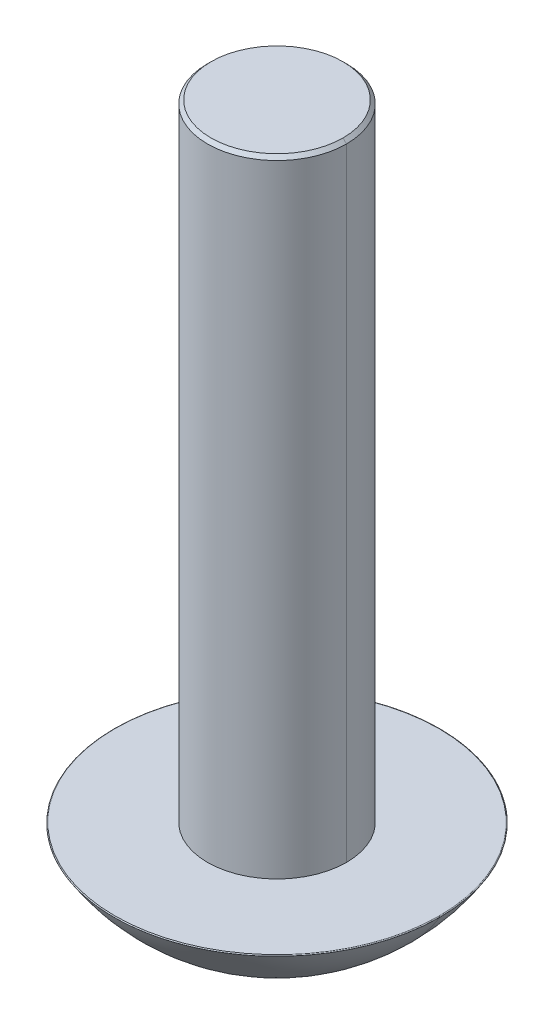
ISO-10303-21;
HEADER;
FILE_DESCRIPTION(('STEP AP214'),'2;1');
FILE_NAME('part.step','',(''),(''),'','','');
FILE_SCHEMA(('AUTOMOTIVE_DESIGN { 1 0 10303 214 1 1 1 1 }'));
ENDSEC;
DATA;
#1=APPLICATION_CONTEXT('core data for automotive mechanical design processes');
#2=APPLICATION_PROTOCOL_DEFINITION('international standard','automotive_design',2000,#1);
#3=PRODUCT_CONTEXT('',#1,'mechanical');
#4=PRODUCT('Part','Part','',(#3));
#5=PRODUCT_RELATED_PRODUCT_CATEGORY('part','',(#4));
#6=PRODUCT_DEFINITION_FORMATION('','',#4);
#7=PRODUCT_DEFINITION_CONTEXT('part definition',#1,'design');
#8=PRODUCT_DEFINITION('design','',#6,#7);
#9=PRODUCT_DEFINITION_SHAPE('','',#8);
#10=(LENGTH_UNIT() NAMED_UNIT(*) SI_UNIT(.MILLI.,.METRE.));
#11=(NAMED_UNIT(*) PLANE_ANGLE_UNIT() SI_UNIT($,.RADIAN.));
#12=(NAMED_UNIT(*) SI_UNIT($,.STERADIAN.) SOLID_ANGLE_UNIT());
#13=UNCERTAINTY_MEASURE_WITH_UNIT(LENGTH_MEASURE(1.E-05),#10,'distance_accuracy_value','');
#14=(GEOMETRIC_REPRESENTATION_CONTEXT(3) GLOBAL_UNCERTAINTY_ASSIGNED_CONTEXT((#13)) GLOBAL_UNIT_ASSIGNED_CONTEXT((#10,
#11,#12)) REPRESENTATION_CONTEXT('',''));
#15=CARTESIAN_POINT('',(0.,0.,0.));
#16=DIRECTION('',(0.,0.,1.));
#17=DIRECTION('',(1.,0.,0.));
#18=AXIS2_PLACEMENT_3D('',#15,#16,#17);
#19=CARTESIAN_POINT('',(2.1,-6.85,0.45));
#20=DIRECTION('',(0.355995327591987,0.934487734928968,0.));
#21=DIRECTION('',(0.,0.,-1.));
#22=AXIS2_PLACEMENT_3D('',#19,#20,#21);
#23=PLANE('',#22);
#24=DIRECTION('',(0.,0.,1.));
#25=VECTOR('',#24,1.);
#26=CARTESIAN_POINT('',(2.1,-6.85,0.45));
#27=LINE('',#26,#25);
#28=CARTESIAN_POINT('',(2.1,-6.85,-0.45));
#29=VERTEX_POINT('',#28);
#30=CARTESIAN_POINT('',(2.1,-6.85,0.45));
#31=VERTEX_POINT('',#30);
#32=EDGE_CURVE('E545',#29,#31,#27,.T.);
#33=ORIENTED_EDGE('',*,*,#32,.T.);
#34=DIRECTION('',(-0.916296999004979,0.349065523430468,-0.196349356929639));
#35=VECTOR('',#34,1.);
#36=CARTESIAN_POINT('',(1.05,-6.45,0.225));
#37=LINE('',#36,#35);
#38=CARTESIAN_POINT('',(0.,-6.05,0.));
#39=VERTEX_POINT('',#38);
#40=EDGE_CURVE('E9',#31,#39,#37,.T.);
#41=ORIENTED_EDGE('',*,*,#40,.T.);
#42=DIRECTION('',(-0.916296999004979,0.349065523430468,0.196349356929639));
#43=VECTOR('',#42,1.);
#44=CARTESIAN_POINT('',(1.05,-6.45,-0.225));
#45=LINE('',#44,#43);
#46=EDGE_CURVE('E201',#29,#39,#45,.T.);
#47=ORIENTED_EDGE('',*,*,#46,.F.);
#48=EDGE_LOOP('',(#33,#41,#47));
#49=FACE_BOUND('',#48,.T.);
#50=ADVANCED_FACE('F15',(#49),#23,.F.);
#51=CARTESIAN_POINT('',(0.45,-6.85,2.1));
#52=CARTESIAN_POINT('',(0.,-6.05,0.));
#53=CARTESIAN_POINT('',(0.45,-6.85,1.97916666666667));
#54=CARTESIAN_POINT('',(0.,-6.05,0.));
#55=CARTESIAN_POINT('',(0.45,-6.85,1.7375));
#56=CARTESIAN_POINT('',(0.,-6.05,0.));
#57=CARTESIAN_POINT('',(0.45,-6.85,1.375));
#58=CARTESIAN_POINT('',(0.,-6.05,0.));
#59=CARTESIAN_POINT('',(0.45,-6.85,1.0125));
#60=CARTESIAN_POINT('',(0.,-6.05,0.));
#61=CARTESIAN_POINT('',(0.45,-6.85,0.770833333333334));
#62=CARTESIAN_POINT('',(0.,-6.05,0.));
#63=CARTESIAN_POINT('',(0.45,-6.85,0.623820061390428));
#64=CARTESIAN_POINT('',(0.,-6.05,0.));
#65=CARTESIAN_POINT('',(0.460399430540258,-6.85,0.571466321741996));
#66=CARTESIAN_POINT('',(0.,-6.05,0.));
#67=CARTESIAN_POINT('',(0.504909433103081,-6.85,0.504879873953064));
#68=CARTESIAN_POINT('',(0.,-6.05,0.));
#69=CARTESIAN_POINT('',(0.571460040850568,-6.85,0.460409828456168));
#70=CARTESIAN_POINT('',(0.,-6.05,0.));
#71=CARTESIAN_POINT('',(0.623820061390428,-6.85,0.45));
#72=CARTESIAN_POINT('',(0.,-6.05,0.));
#73=CARTESIAN_POINT('',(0.770833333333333,-6.85,0.45));
#74=CARTESIAN_POINT('',(0.,-6.05,0.));
#75=CARTESIAN_POINT('',(1.0125,-6.85,0.45));
#76=CARTESIAN_POINT('',(0.,-6.05,0.));
#77=CARTESIAN_POINT('',(1.375,-6.85,0.45));
#78=CARTESIAN_POINT('',(0.,-6.05,0.));
#79=CARTESIAN_POINT('',(1.7375,-6.85,0.45));
#80=CARTESIAN_POINT('',(0.,-6.05,0.));
#81=CARTESIAN_POINT('',(1.97916666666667,-6.85,0.45));
#82=CARTESIAN_POINT('',(0.,-6.05,0.));
#83=CARTESIAN_POINT('',(2.1,-6.85,0.45));
#84=CARTESIAN_POINT('',(0.,-6.05,0.));
#85=(BOUNDED_SURFACE() B_SPLINE_SURFACE(3,1,((#51,#52),(#53,#54),(#55,#56),(#57,#58),(#59,#60),
(#61,#62),(#63,#64),(#65,#66),(#67,#68),(#69,#70),(#71,#72),(#73,#74),(#75,#76),(#77,#78),(#79,
#80),(#81,#82),(#83,#84)),.UNSPECIFIED.,.F.,.F.,.F.) B_SPLINE_SURFACE_WITH_KNOTS((4,1,1,1,2,1,1,
1,2,1,1,1,4),(2,2),(0.,0.112782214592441,0.225564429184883,0.338346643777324,0.451128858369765,
0.475564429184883,0.5,0.524435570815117,0.548871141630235,0.661653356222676,0.774435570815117,
0.887217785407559,1.),(0.,1.),
.UNSPECIFIED.) GEOMETRIC_REPRESENTATION_ITEM() RATIONAL_B_SPLINE_SURFACE(((1.,1.),(1.,1.),(1.,
1.),(1.,1.),(1.,1.),(1.,1.),(1.,1.),(1.,1.),(1.,1.),(1.,1.),(1.,1.),(1.,1.),(1.,1.),(1.,1.),(1.,
1.),(1.,1.),(1.,1.))) REPRESENTATION_ITEM('') SURFACE());
#86=CARTESIAN_POINT('',(0.45,-6.85,0.65));
#87=CARTESIAN_POINT('',(0.45,-6.85,0.770833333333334));
#88=CARTESIAN_POINT('',(0.45,-6.85,1.0125));
#89=CARTESIAN_POINT('',(0.45,-6.85,1.375));
#90=CARTESIAN_POINT('',(0.45,-6.85,1.7375));
#91=CARTESIAN_POINT('',(0.45,-6.85,1.97916666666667));
#92=CARTESIAN_POINT('',(0.45,-6.85,2.1));
#93=(BOUNDED_CURVE() B_SPLINE_CURVE(3,(#86,#87,#88,#89,#90,#91,#92),.UNSPECIFIED.,.F.,
.F.) B_SPLINE_CURVE_WITH_KNOTS((4,1,1,1,4),(0.,0.250000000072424,0.500000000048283,
0.750000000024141,1.),
.UNSPECIFIED.) CURVE() GEOMETRIC_REPRESENTATION_ITEM() RATIONAL_B_SPLINE_CURVE((1.,1.,1.,1.,1.,
1.,1.)) REPRESENTATION_ITEM(''));
#94=CARTESIAN_POINT('',(0.45,-6.85,0.65));
#95=VERTEX_POINT('',#94);
#96=CARTESIAN_POINT('',(0.45,-6.85,2.1));
#97=VERTEX_POINT('',#96);
#98=EDGE_CURVE('E501',#95,#97,#93,.T.);
#99=DIRECTION('',(-0.196349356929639,0.349065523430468,-0.916296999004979));
#100=VECTOR('',#99,1.);
#101=CARTESIAN_POINT('',(0.225,-6.45,1.05));
#102=LINE('',#101,#100);
#103=EDGE_CURVE('E27',#97,#39,#102,.T.);
#104=CARTESIAN_POINT('',(0.65,-6.85,0.45));
#105=CARTESIAN_POINT('',(1.13333333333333,-6.85,0.45));
#106=CARTESIAN_POINT('',(1.61666666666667,-6.85,0.45));
#107=CARTESIAN_POINT('',(2.1,-6.85,0.45));
#108=(BOUNDED_CURVE() B_SPLINE_CURVE(3,(#104,#105,#106,#107),.UNSPECIFIED.,.F.,
.F.) B_SPLINE_CURVE_WITH_KNOTS((4,4),(0.,1.),
.UNSPECIFIED.) CURVE() GEOMETRIC_REPRESENTATION_ITEM() RATIONAL_B_SPLINE_CURVE((1.,1.,1.,1.)) REPRESENTATION_ITEM(''));
#109=CARTESIAN_POINT('',(0.65,-6.85,0.45));
#110=VERTEX_POINT('',#109);
#111=EDGE_CURVE('E511',#110,#31,#108,.T.);
#112=CARTESIAN_POINT('',(2.1,-6.85,0.45));
#113=CARTESIAN_POINT('',(1.97916666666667,-6.85,0.45));
#114=CARTESIAN_POINT('',(1.7375,-6.85,0.45));
#115=CARTESIAN_POINT('',(1.375,-6.85,0.45));
#116=CARTESIAN_POINT('',(1.0125,-6.85,0.45));
#117=CARTESIAN_POINT('',(0.770833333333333,-6.85,0.45));
#118=CARTESIAN_POINT('',(0.623820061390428,-6.85,0.45));
#119=CARTESIAN_POINT('',(0.571460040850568,-6.85,0.460409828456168));
#120=CARTESIAN_POINT('',(0.504909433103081,-6.85,0.504879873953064));
#121=CARTESIAN_POINT('',(0.460399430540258,-6.85,0.571466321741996));
#122=CARTESIAN_POINT('',(0.45,-6.85,0.623820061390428));
#123=CARTESIAN_POINT('',(0.45,-6.85,0.770833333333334));
#124=CARTESIAN_POINT('',(0.45,-6.85,1.0125));
#125=CARTESIAN_POINT('',(0.45,-6.85,1.375));
#126=CARTESIAN_POINT('',(0.45,-6.85,1.7375));
#127=CARTESIAN_POINT('',(0.45,-6.85,1.97916666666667));
#128=CARTESIAN_POINT('',(0.45,-6.85,2.1));
#129=(BOUNDED_CURVE() B_SPLINE_CURVE(3,(#112,#113,#114,#115,#116,#117,#118,#119,#120,#121,#122,
#123,#124,#125,#126,#127,#128),.UNSPECIFIED.,.F.,.F.) B_SPLINE_CURVE_WITH_KNOTS((4,1,1,1,2,1,1,
1,2,1,1,1,4),(0.,0.112782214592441,0.225564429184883,0.338346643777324,0.451128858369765,
0.475564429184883,0.5,0.524435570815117,0.548871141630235,0.661653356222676,0.774435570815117,
0.887217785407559,1.),
.UNSPECIFIED.) CURVE() GEOMETRIC_REPRESENTATION_ITEM() RATIONAL_B_SPLINE_CURVE((1.,1.,1.,1.,1.,
1.,1.,1.,1.,1.,1.,1.,1.,1.,1.,1.,1.)) REPRESENTATION_ITEM(''));
#130=EDGE_CURVE('E490',#95,#110,#129,.F.);
#131=ORIENTED_EDGE('',*,*,#98,.T.);
#132=ORIENTED_EDGE('',*,*,#103,.T.);
#133=ORIENTED_EDGE('',*,*,#40,.F.);
#134=ORIENTED_EDGE('',*,*,#111,.F.);
#135=ORIENTED_EDGE('',*,*,#130,.F.);
#136=EDGE_LOOP('',(#131,#132,#133,#134,#135));
#137=FACE_BOUND('',#136,.T.);
#138=ADVANCED_FACE('F407',(#137),#85,.F.);
#139=CARTESIAN_POINT('',(-0.45,-6.85,2.1));
#140=DIRECTION('',(0.,0.934487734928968,0.355995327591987));
#141=DIRECTION('',(1.,0.,0.));
#142=AXIS2_PLACEMENT_3D('',#139,#140,#141);
#143=PLANE('',#142);
#144=DIRECTION('',(-1.,0.,0.));
#145=VECTOR('',#144,1.);
#146=CARTESIAN_POINT('',(-0.45,-6.85,2.1));
#147=LINE('',#146,#145);
#148=CARTESIAN_POINT('',(-0.45,-6.85,2.1));
#149=VERTEX_POINT('',#148);
#150=EDGE_CURVE('E1134',#97,#149,#147,.T.);
#151=ORIENTED_EDGE('',*,*,#150,.T.);
#152=DIRECTION('',(0.196349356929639,0.349065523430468,-0.916296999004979));
#153=VECTOR('',#152,1.);
#154=CARTESIAN_POINT('',(-0.225,-6.45,1.05));
#155=LINE('',#154,#153);
#156=EDGE_CURVE('E1136',#149,#39,#155,.T.);
#157=ORIENTED_EDGE('',*,*,#156,.T.);
#158=ORIENTED_EDGE('',*,*,#103,.F.);
#159=EDGE_LOOP('',(#151,#157,#158));
#160=FACE_BOUND('',#159,.T.);
#161=ADVANCED_FACE('F296',(#160),#143,.F.);
#162=CARTESIAN_POINT('',(-2.1,-6.85,0.35));
#163=CARTESIAN_POINT('',(0.,-6.05,0.));
#164=CARTESIAN_POINT('',(-1.97916666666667,-6.85,0.35));
#165=CARTESIAN_POINT('',(0.,-6.05,0.));
#166=CARTESIAN_POINT('',(-1.7375,-6.85,0.35));
#167=CARTESIAN_POINT('',(0.,-6.05,0.));
#168=CARTESIAN_POINT('',(-1.375,-6.85,0.35));
#169=CARTESIAN_POINT('',(0.,-6.05,0.));
#170=CARTESIAN_POINT('',(-1.0125,-6.85,0.35));
#171=CARTESIAN_POINT('',(0.,-6.05,0.));
#172=CARTESIAN_POINT('',(-0.770833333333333,-6.85,0.35));
#173=CARTESIAN_POINT('',(0.,-6.05,0.));
#174=CARTESIAN_POINT('',(-0.623820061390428,-6.85,0.35));
#175=CARTESIAN_POINT('',(0.,-6.05,0.));
#176=CARTESIAN_POINT('',(-0.571466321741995,-6.85,0.360399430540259));
#177=CARTESIAN_POINT('',(0.,-6.05,0.));
#178=CARTESIAN_POINT('',(-0.504879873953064,-6.85,0.40490943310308));
#179=CARTESIAN_POINT('',(0.,-6.05,0.));
#180=CARTESIAN_POINT('',(-0.460409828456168,-6.85,0.471460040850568));
#181=CARTESIAN_POINT('',(0.,-6.05,0.));
#182=CARTESIAN_POINT('',(-0.45,-6.85,0.523820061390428));
#183=CARTESIAN_POINT('',(0.,-6.05,0.));
#184=CARTESIAN_POINT('',(-0.45,-6.85,0.679166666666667));
#185=CARTESIAN_POINT('',(0.,-6.05,0.));
#186=CARTESIAN_POINT('',(-0.45,-6.85,0.9375));
#187=CARTESIAN_POINT('',(0.,-6.05,0.));
#188=CARTESIAN_POINT('',(-0.45,-6.85,1.325));
#189=CARTESIAN_POINT('',(0.,-6.05,0.));
#190=CARTESIAN_POINT('',(-0.45,-6.85,1.7125));
#191=CARTESIAN_POINT('',(0.,-6.05,0.));
#192=CARTESIAN_POINT('',(-0.45,-6.85,1.97083333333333));
#193=CARTESIAN_POINT('',(0.,-6.05,0.));
#194=CARTESIAN_POINT('',(-0.45,-6.85,2.1));
#195=CARTESIAN_POINT('',(0.,-6.05,0.));
#196=(BOUNDED_SURFACE() B_SPLINE_SURFACE(3,1,((#162,#163),(#164,#165),(#166,#167),(#168,#169),
(#170,#171),(#172,#173),(#174,#175),(#176,#177),(#178,#179),(#180,#181),(#182,#183),(#184,#185),
(#186,#187),(#188,#189),(#190,#191),(#192,#193),(#194,#195)),.UNSPECIFIED.,.F.,.F.,
.F.) B_SPLINE_SURFACE_WITH_KNOTS((4,1,1,1,2,1,1,1,2,1,1,1,4),(2,2),(0.,0.109379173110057,
0.218758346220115,0.328137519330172,0.437516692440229,0.461214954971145,0.484913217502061,
0.508611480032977,0.532309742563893,0.64923230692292,0.766154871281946,0.883077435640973,1.),
(0.,1.),.UNSPECIFIED.) GEOMETRIC_REPRESENTATION_ITEM() RATIONAL_B_SPLINE_SURFACE(((1.,1.),(1.,
1.),(1.,1.),(1.,1.),(1.,1.),(1.,1.),(1.,1.),(1.,1.),(1.,1.),(1.,1.),(1.,1.),(1.,1.),(1.,1.),(1.,
1.),(1.,1.),(1.,1.),(1.,1.))) REPRESENTATION_ITEM('') SURFACE());
#197=CARTESIAN_POINT('',(-0.65,-6.85,0.35));
#198=CARTESIAN_POINT('',(-0.770833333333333,-6.85,0.35));
#199=CARTESIAN_POINT('',(-1.0125,-6.85,0.35));
#200=CARTESIAN_POINT('',(-1.375,-6.85,0.35));
#201=CARTESIAN_POINT('',(-1.7375,-6.85,0.35));
#202=CARTESIAN_POINT('',(-1.97916666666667,-6.85,0.35));
#203=CARTESIAN_POINT('',(-2.1,-6.85,0.35));
#204=(BOUNDED_CURVE() B_SPLINE_CURVE(3,(#197,#198,#199,#200,#201,#202,#203),.UNSPECIFIED.,.F.,
.F.) B_SPLINE_CURVE_WITH_KNOTS((4,1,1,1,4),(0.,0.250000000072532,0.500000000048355,
0.750000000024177,1.),
.UNSPECIFIED.) CURVE() GEOMETRIC_REPRESENTATION_ITEM() RATIONAL_B_SPLINE_CURVE((1.,1.,1.,1.,1.,
1.,1.)) REPRESENTATION_ITEM(''));
#205=CARTESIAN_POINT('',(-0.65,-6.85,0.35));
#206=VERTEX_POINT('',#205);
#207=CARTESIAN_POINT('',(-2.1,-6.85,0.35));
#208=VERTEX_POINT('',#207);
#209=EDGE_CURVE('E1355',#206,#208,#204,.T.);
#210=DIRECTION('',(0.923355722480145,0.351754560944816,-0.153892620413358));
#211=VECTOR('',#210,1.);
#212=CARTESIAN_POINT('',(-1.05,-6.45,0.175));
#213=LINE('',#212,#211);
#214=EDGE_CURVE('E200',#208,#39,#213,.T.);
#215=CARTESIAN_POINT('',(-0.45,-6.85,2.1));
#216=CARTESIAN_POINT('',(-0.45,-6.85,1.97083333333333));
#217=CARTESIAN_POINT('',(-0.45,-6.85,1.7125));
#218=CARTESIAN_POINT('',(-0.45,-6.85,1.325));
#219=CARTESIAN_POINT('',(-0.45,-6.85,0.9375));
#220=CARTESIAN_POINT('',(-0.45,-6.85,0.679166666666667));
#221=CARTESIAN_POINT('',(-0.45,-6.85,0.55));
#222=(BOUNDED_CURVE() B_SPLINE_CURVE(3,(#215,#216,#217,#218,#219,#220,#221),.UNSPECIFIED.,.F.,
.F.) B_SPLINE_CURVE_WITH_KNOTS((4,1,1,1,4),(0.,0.249999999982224,0.499999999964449,
0.749999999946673,1.),
.UNSPECIFIED.) CURVE() GEOMETRIC_REPRESENTATION_ITEM() RATIONAL_B_SPLINE_CURVE((1.,1.,1.,1.,1.,
1.,1.)) REPRESENTATION_ITEM(''));
#223=CARTESIAN_POINT('',(-0.45,-6.85,0.55));
#224=VERTEX_POINT('',#223);
#225=EDGE_CURVE('E326',#149,#224,#222,.T.);
#226=CARTESIAN_POINT('',(-0.449999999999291,-6.84999999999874,2.09999999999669));
#227=CARTESIAN_POINT('',(-0.449999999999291,-6.84999999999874,1.97083333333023));
#228=CARTESIAN_POINT('',(-0.449999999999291,-6.84999999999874,1.7124999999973));
#229=CARTESIAN_POINT('',(-0.449999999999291,-6.84999999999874,1.32499999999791));
#230=CARTESIAN_POINT('',(-0.449999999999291,-6.84999999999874,0.937499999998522));
#231=CARTESIAN_POINT('',(-0.449999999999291,-6.84999999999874,0.679166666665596));
#232=CARTESIAN_POINT('',(-0.449999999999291,-6.84999999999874,0.523820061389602));
#233=CARTESIAN_POINT('',(-0.460409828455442,-6.84999999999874,0.471460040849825));
#234=CARTESIAN_POINT('',(-0.504879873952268,-6.84999999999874,0.404909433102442));
#235=CARTESIAN_POINT('',(-0.571466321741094,-6.84999999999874,0.360399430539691));
#236=CARTESIAN_POINT('',(-0.623820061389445,-6.84999999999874,0.349999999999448));
#237=CARTESIAN_POINT('',(-0.770833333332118,-6.84999999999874,0.349999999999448));
#238=CARTESIAN_POINT('',(-1.0124999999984,-6.84999999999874,0.349999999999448));
#239=CARTESIAN_POINT('',(-1.37499999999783,-6.84999999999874,0.349999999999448));
#240=CARTESIAN_POINT('',(-1.73749999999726,-6.84999999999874,0.349999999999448));
#241=CARTESIAN_POINT('',(-1.97916666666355,-6.84999999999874,0.349999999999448));
#242=CARTESIAN_POINT('',(-2.09999999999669,-6.84999999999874,0.349999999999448));
#243=(BOUNDED_CURVE() B_SPLINE_CURVE(3,(#226,#227,#228,#229,#230,#231,#232,#233,#234,#235,#236,
#237,#238,#239,#240,#241,#242),.UNSPECIFIED.,.F.,.F.) B_SPLINE_CURVE_WITH_KNOTS((4,1,1,1,2,1,1,
1,2,1,1,1,4),(0.,0.116922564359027,0.233845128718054,0.35076769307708,0.467690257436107,
0.491388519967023,0.515086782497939,0.538785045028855,0.562483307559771,0.671862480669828,
0.781241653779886,0.890620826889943,1.),
.UNSPECIFIED.) CURVE() GEOMETRIC_REPRESENTATION_ITEM() RATIONAL_B_SPLINE_CURVE((1.,1.,1.,1.,1.,
1.,1.,1.,1.,1.,1.,1.,1.,1.,1.,1.,1.)) REPRESENTATION_ITEM(''));
#244=EDGE_CURVE('E321',#224,#206,#243,.T.);
#245=ORIENTED_EDGE('',*,*,#209,.T.);
#246=ORIENTED_EDGE('',*,*,#214,.T.);
#247=ORIENTED_EDGE('',*,*,#156,.F.);
#248=ORIENTED_EDGE('',*,*,#225,.T.);
#249=ORIENTED_EDGE('',*,*,#244,.T.);
#250=EDGE_LOOP('',(#245,#246,#247,#248,#249));
#251=FACE_BOUND('',#250,.T.);
#252=ADVANCED_FACE('F290',(#251),#196,.F.);
#253=CARTESIAN_POINT('',(-2.1,-6.85,-0.45));
#254=DIRECTION('',(-0.355995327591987,0.934487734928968,0.));
#255=DIRECTION('',(0.,0.,1.));
#256=AXIS2_PLACEMENT_3D('',#253,#254,#255);
#257=PLANE('',#256);
#258=DIRECTION('',(0.,0.,-1.));
#259=VECTOR('',#258,1.);
#260=CARTESIAN_POINT('',(-2.1,-6.85,-0.45));
#261=LINE('',#260,#259);
#262=CARTESIAN_POINT('',(-2.1,-6.85,-0.45));
#263=VERTEX_POINT('',#262);
#264=EDGE_CURVE('E204',#208,#263,#261,.T.);
#265=ORIENTED_EDGE('',*,*,#264,.T.);
#266=DIRECTION('',(0.916296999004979,0.349065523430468,0.196349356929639));
#267=VECTOR('',#266,1.);
#268=CARTESIAN_POINT('',(-1.05,-6.45,-0.225));
#269=LINE('',#268,#267);
#270=EDGE_CURVE('E187',#263,#39,#269,.T.);
#271=ORIENTED_EDGE('',*,*,#270,.T.);
#272=ORIENTED_EDGE('',*,*,#214,.F.);
#273=EDGE_LOOP('',(#265,#271,#272));
#274=FACE_BOUND('',#273,.T.);
#275=ADVANCED_FACE('F206',(#274),#257,.F.);
#276=CARTESIAN_POINT('',(-0.45,-6.85,-2.1));
#277=CARTESIAN_POINT('',(0.,-6.05,0.));
#278=CARTESIAN_POINT('',(-0.45,-6.85,-1.97916666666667));
#279=CARTESIAN_POINT('',(0.,-6.05,0.));
#280=CARTESIAN_POINT('',(-0.45,-6.85,-1.7375));
#281=CARTESIAN_POINT('',(0.,-6.05,0.));
#282=CARTESIAN_POINT('',(-0.45,-6.85,-1.375));
#283=CARTESIAN_POINT('',(0.,-6.05,0.));
#284=CARTESIAN_POINT('',(-0.45,-6.85,-1.0125));
#285=CARTESIAN_POINT('',(0.,-6.05,0.));
#286=CARTESIAN_POINT('',(-0.45,-6.85,-0.770833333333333));
#287=CARTESIAN_POINT('',(0.,-6.05,0.));
#288=CARTESIAN_POINT('',(-0.45,-6.85,-0.623820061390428));
#289=CARTESIAN_POINT('',(0.,-6.05,0.));
#290=CARTESIAN_POINT('',(-0.460399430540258,-6.85,-0.571466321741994));
#291=CARTESIAN_POINT('',(0.,-6.05,0.));
#292=CARTESIAN_POINT('',(-0.504909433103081,-6.85,-0.504879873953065));
#293=CARTESIAN_POINT('',(0.,-6.05,0.));
#294=CARTESIAN_POINT('',(-0.571460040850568,-6.85,-0.460409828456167));
#295=CARTESIAN_POINT('',(0.,-6.05,0.));
#296=CARTESIAN_POINT('',(-0.623820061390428,-6.85,-0.45));
#297=CARTESIAN_POINT('',(0.,-6.05,0.));
#298=CARTESIAN_POINT('',(-0.770833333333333,-6.85,-0.45));
#299=CARTESIAN_POINT('',(0.,-6.05,0.));
#300=CARTESIAN_POINT('',(-1.0125,-6.85,-0.45));
#301=CARTESIAN_POINT('',(0.,-6.05,0.));
#302=CARTESIAN_POINT('',(-1.375,-6.85,-0.45));
#303=CARTESIAN_POINT('',(0.,-6.05,0.));
#304=CARTESIAN_POINT('',(-1.7375,-6.85,-0.45));
#305=CARTESIAN_POINT('',(0.,-6.05,0.));
#306=CARTESIAN_POINT('',(-1.97916666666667,-6.85,-0.45));
#307=CARTESIAN_POINT('',(0.,-6.05,0.));
#308=CARTESIAN_POINT('',(-2.1,-6.85,-0.45));
#309=CARTESIAN_POINT('',(0.,-6.05,0.));
#310=(BOUNDED_SURFACE() B_SPLINE_SURFACE(3,1,((#276,#277),(#278,#279),(#280,#281),(#282,#283),
(#284,#285),(#286,#287),(#288,#289),(#290,#291),(#292,#293),(#294,#295),(#296,#297),(#298,#299),
(#300,#301),(#302,#303),(#304,#305),(#306,#307),(#308,#309)),.UNSPECIFIED.,.F.,.F.,
.F.) B_SPLINE_SURFACE_WITH_KNOTS((4,1,1,1,2,1,1,1,2,1,1,1,4),(2,2),(0.,0.112782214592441,
0.225564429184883,0.338346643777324,0.451128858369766,0.475564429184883,0.5,0.524435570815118,
0.548871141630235,0.661653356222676,0.774435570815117,0.887217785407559,1.),(0.,1.),
.UNSPECIFIED.) GEOMETRIC_REPRESENTATION_ITEM() RATIONAL_B_SPLINE_SURFACE(((1.,1.),(1.,1.),(1.,
1.),(1.,1.),(1.,1.),(1.,1.),(1.,1.),(1.,1.),(1.,1.),(1.,1.),(1.,1.),(1.,1.),(1.,1.),(1.,1.),(1.,
1.),(1.,1.),(1.,1.))) REPRESENTATION_ITEM('') SURFACE());
#311=CARTESIAN_POINT('',(-0.45,-6.85,-0.65));
#312=CARTESIAN_POINT('',(-0.45,-6.85,-0.770833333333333));
#313=CARTESIAN_POINT('',(-0.45,-6.85,-1.0125));
#314=CARTESIAN_POINT('',(-0.45,-6.85,-1.375));
#315=CARTESIAN_POINT('',(-0.45,-6.85,-1.7375));
#316=CARTESIAN_POINT('',(-0.45,-6.85,-1.97916666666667));
#317=CARTESIAN_POINT('',(-0.45,-6.85,-2.1));
#318=(BOUNDED_CURVE() B_SPLINE_CURVE(3,(#311,#312,#313,#314,#315,#316,#317),.UNSPECIFIED.,.F.,
.F.) B_SPLINE_CURVE_WITH_KNOTS((4,1,1,1,4),(0.,0.250000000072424,0.500000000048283,
0.750000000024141,1.),
.UNSPECIFIED.) CURVE() GEOMETRIC_REPRESENTATION_ITEM() RATIONAL_B_SPLINE_CURVE((1.,1.,1.,1.,1.,
1.,1.)) REPRESENTATION_ITEM(''));
#319=CARTESIAN_POINT('',(-0.45,-6.85,-0.65));
#320=VERTEX_POINT('',#319);
#321=CARTESIAN_POINT('',(-0.45,-6.85,-2.1));
#322=VERTEX_POINT('',#321);
#323=EDGE_CURVE('E1362',#320,#322,#318,.T.);
#324=DIRECTION('',(0.196349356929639,0.349065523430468,0.916296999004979));
#325=VECTOR('',#324,1.);
#326=CARTESIAN_POINT('',(-0.225,-6.45,-1.05));
#327=LINE('',#326,#325);
#328=EDGE_CURVE('E195',#322,#39,#327,.T.);
#329=CARTESIAN_POINT('',(-0.65,-6.85,-0.45));
#330=CARTESIAN_POINT('',(-1.13333333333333,-6.85,-0.45));
#331=CARTESIAN_POINT('',(-1.61666666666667,-6.85,-0.45));
#332=CARTESIAN_POINT('',(-2.1,-6.85,-0.45));
#333=(BOUNDED_CURVE() B_SPLINE_CURVE(3,(#329,#330,#331,#332),.UNSPECIFIED.,.F.,
.F.) B_SPLINE_CURVE_WITH_KNOTS((4,4),(0.,1.),
.UNSPECIFIED.) CURVE() GEOMETRIC_REPRESENTATION_ITEM() RATIONAL_B_SPLINE_CURVE((1.,1.,1.,1.)) REPRESENTATION_ITEM(''));
#334=CARTESIAN_POINT('',(-0.65,-6.85,-0.45));
#335=VERTEX_POINT('',#334);
#336=EDGE_CURVE('E192',#335,#263,#333,.T.);
#337=CARTESIAN_POINT('',(-2.1,-6.85,-0.45));
#338=CARTESIAN_POINT('',(-1.97916666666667,-6.85,-0.45));
#339=CARTESIAN_POINT('',(-1.7375,-6.85,-0.45));
#340=CARTESIAN_POINT('',(-1.375,-6.85,-0.45));
#341=CARTESIAN_POINT('',(-1.0125,-6.85,-0.45));
#342=CARTESIAN_POINT('',(-0.770833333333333,-6.85,-0.45));
#343=CARTESIAN_POINT('',(-0.623820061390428,-6.85,-0.45));
#344=CARTESIAN_POINT('',(-0.571460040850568,-6.85,-0.460409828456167));
#345=CARTESIAN_POINT('',(-0.504909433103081,-6.85,-0.504879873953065));
#346=CARTESIAN_POINT('',(-0.460399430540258,-6.85,-0.571466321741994));
#347=CARTESIAN_POINT('',(-0.45,-6.85,-0.623820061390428));
#348=CARTESIAN_POINT('',(-0.45,-6.85,-0.770833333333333));
#349=CARTESIAN_POINT('',(-0.45,-6.85,-1.0125));
#350=CARTESIAN_POINT('',(-0.45,-6.85,-1.375));
#351=CARTESIAN_POINT('',(-0.45,-6.85,-1.7375));
#352=CARTESIAN_POINT('',(-0.45,-6.85,-1.97916666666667));
#353=CARTESIAN_POINT('',(-0.45,-6.85,-2.1));
#354=(BOUNDED_CURVE() B_SPLINE_CURVE(3,(#337,#338,#339,#340,#341,#342,#343,#344,#345,#346,#347,
#348,#349,#350,#351,#352,#353),.UNSPECIFIED.,.F.,.F.) B_SPLINE_CURVE_WITH_KNOTS((4,1,1,1,2,1,1,
1,2,1,1,1,4),(0.,0.112782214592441,0.225564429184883,0.338346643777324,0.451128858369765,
0.475564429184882,0.5,0.524435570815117,0.548871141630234,0.661653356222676,0.774435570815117,
0.887217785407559,1.),
.UNSPECIFIED.) CURVE() GEOMETRIC_REPRESENTATION_ITEM() RATIONAL_B_SPLINE_CURVE((1.,1.,1.,1.,1.,
1.,1.,1.,1.,1.,1.,1.,1.,1.,1.,1.,1.)) REPRESENTATION_ITEM(''));
#355=EDGE_CURVE('E234',#320,#335,#354,.F.);
#356=ORIENTED_EDGE('',*,*,#323,.T.);
#357=ORIENTED_EDGE('',*,*,#328,.T.);
#358=ORIENTED_EDGE('',*,*,#270,.F.);
#359=ORIENTED_EDGE('',*,*,#336,.F.);
#360=ORIENTED_EDGE('',*,*,#355,.F.);
#361=EDGE_LOOP('',(#356,#357,#358,#359,#360));
#362=FACE_BOUND('',#361,.T.);
#363=ADVANCED_FACE('F190',(#362),#310,.F.);
#364=CARTESIAN_POINT('',(2.1,-6.85,-0.45));
#365=DIRECTION('',(0.,0.490261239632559,-0.871575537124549));
#366=DIRECTION('',(-1.,0.,0.));
#367=AXIS2_PLACEMENT_3D('',#364,#365,#366);
#368=PLANE('',#367);
#369=CARTESIAN_POINT('',(0.65,-6.85,-0.45));
#370=CARTESIAN_POINT('',(1.13333333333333,-6.85,-0.45));
#371=CARTESIAN_POINT('',(1.61666666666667,-6.85,-0.45));
#372=CARTESIAN_POINT('',(2.1,-6.85,-0.45));
#373=(BOUNDED_CURVE() B_SPLINE_CURVE(3,(#369,#370,#371,#372),.UNSPECIFIED.,.F.,
.F.) B_SPLINE_CURVE_WITH_KNOTS((4,4),(0.,1.),
.UNSPECIFIED.) CURVE() GEOMETRIC_REPRESENTATION_ITEM() RATIONAL_B_SPLINE_CURVE((1.,1.,1.,1.)) REPRESENTATION_ITEM(''));
#374=CARTESIAN_POINT('',(0.65,-6.85,-0.45));
#375=VERTEX_POINT('',#374);
#376=EDGE_CURVE('E556',#375,#29,#373,.T.);
#377=ORIENTED_EDGE('',*,*,#376,.T.);
#378=ORIENTED_EDGE('',*,*,#46,.T.);
#379=DIRECTION('',(0.577920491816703,-0.711286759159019,-0.400098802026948));
#380=VECTOR('',#379,1.);
#381=CARTESIAN_POINT('',(0.325,-6.45,-0.225));
#382=LINE('',#381,#380);
#383=EDGE_CURVE('E552',#39,#375,#382,.T.);
#384=ORIENTED_EDGE('',*,*,#383,.T.);
#385=EDGE_LOOP('',(#377,#378,#384));
#386=FACE_BOUND('',#385,.T.);
#387=ADVANCED_FACE('F724',(#386),#368,.F.);
#388=CARTESIAN_POINT('',(0.45,-6.85,-2.1));
#389=DIRECTION('',(0.,0.934487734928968,-0.355995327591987));
#390=DIRECTION('',(-1.,0.,0.));
#391=AXIS2_PLACEMENT_3D('',#388,#389,#390);
#392=PLANE('',#391);
#393=DIRECTION('',(-1.,0.,0.));
#394=VECTOR('',#393,1.);
#395=CARTESIAN_POINT('',(0.45,-6.85,-2.1));
#396=LINE('',#395,#394);
#397=CARTESIAN_POINT('',(0.45,-6.85,-2.1));
#398=VERTEX_POINT('',#397);
#399=EDGE_CURVE('E1203',#398,#322,#396,.T.);
#400=ORIENTED_EDGE('',*,*,#399,.F.);
#401=DIRECTION('',(-0.196349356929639,0.349065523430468,0.916296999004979));
#402=VECTOR('',#401,1.);
#403=CARTESIAN_POINT('',(0.225,-6.45,-1.05));
#404=LINE('',#403,#402);
#405=EDGE_CURVE('E555',#398,#39,#404,.T.);
#406=ORIENTED_EDGE('',*,*,#405,.T.);
#407=ORIENTED_EDGE('',*,*,#328,.F.);
#408=EDGE_LOOP('',(#400,#406,#407));
#409=FACE_BOUND('',#408,.T.);
#410=ADVANCED_FACE('F277',(#409),#392,.F.);
#411=CARTESIAN_POINT('',(0.65,-6.85,-0.45));
#412=CARTESIAN_POINT('',(0.,-6.05,0.));
#413=CARTESIAN_POINT('',(0.623820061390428,-6.85,-0.45));
#414=CARTESIAN_POINT('',(0.,-6.05,0.));
#415=CARTESIAN_POINT('',(0.571466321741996,-6.85,-0.460399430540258));
#416=CARTESIAN_POINT('',(0.,-6.05,0.));
#417=CARTESIAN_POINT('',(0.504879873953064,-6.85,-0.504909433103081));
#418=CARTESIAN_POINT('',(0.,-6.05,0.));
#419=CARTESIAN_POINT('',(0.460409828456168,-6.85,-0.571460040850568));
#420=CARTESIAN_POINT('',(0.,-6.05,0.));
#421=CARTESIAN_POINT('',(0.45,-6.85,-0.623820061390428));
#422=CARTESIAN_POINT('',(0.,-6.05,0.));
#423=CARTESIAN_POINT('',(0.45,-6.85,-0.770833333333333));
#424=CARTESIAN_POINT('',(0.,-6.05,0.));
#425=CARTESIAN_POINT('',(0.45,-6.85,-1.0125));
#426=CARTESIAN_POINT('',(0.,-6.05,0.));
#427=CARTESIAN_POINT('',(0.45,-6.85,-1.375));
#428=CARTESIAN_POINT('',(0.,-6.05,0.));
#429=CARTESIAN_POINT('',(0.45,-6.85,-1.7375));
#430=CARTESIAN_POINT('',(0.,-6.05,0.));
#431=CARTESIAN_POINT('',(0.45,-6.85,-1.97916666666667));
#432=CARTESIAN_POINT('',(0.,-6.05,0.));
#433=CARTESIAN_POINT('',(0.45,-6.85,-2.1));
#434=CARTESIAN_POINT('',(0.,-6.05,0.));
#435=(BOUNDED_SURFACE() B_SPLINE_SURFACE(3,1,((#411,#412),(#413,#414),(#415,#416),(#417,#418),
(#419,#420),(#421,#422),(#423,#424),(#425,#426),(#427,#428),(#429,#430),(#431,#432),(#433,
#434)),.UNSPECIFIED.,.F.,.F.,.F.) B_SPLINE_SURFACE_WITH_KNOTS((4,1,1,1,2,1,1,1,4),(2,2),(0.,
0.0445196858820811,0.0890393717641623,0.133559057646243,0.178078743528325,0.383559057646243,
0.589039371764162,0.794519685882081,1.),(0.,1.),
.UNSPECIFIED.) GEOMETRIC_REPRESENTATION_ITEM() RATIONAL_B_SPLINE_SURFACE(((1.,1.),(1.,1.),(1.,
1.),(1.,1.),(1.,1.),(1.,1.),(1.,1.),(1.,1.),(1.,1.),(1.,1.),(1.,1.),(1.,1.))) REPRESENTATION_ITEM('') SURFACE());
#436=CARTESIAN_POINT('',(0.449999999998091,-6.84999999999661,-2.09999999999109));
#437=CARTESIAN_POINT('',(0.449999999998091,-6.84999999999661,-1.97916666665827));
#438=CARTESIAN_POINT('',(0.449999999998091,-6.84999999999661,-1.73749999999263));
#439=CARTESIAN_POINT('',(0.449999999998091,-6.84999999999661,-1.37499999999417));
#440=CARTESIAN_POINT('',(0.449999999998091,-6.84999999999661,-1.01249999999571));
#441=CARTESIAN_POINT('',(0.449999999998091,-6.84999999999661,-0.770833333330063));
#442=CARTESIAN_POINT('',(0.449999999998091,-6.84999999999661,-0.623820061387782));
#443=CARTESIAN_POINT('',(0.460409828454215,-6.84999999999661,-0.571460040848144));
#444=CARTESIAN_POINT('',(0.504879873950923,-6.84999999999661,-0.504909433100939));
#445=CARTESIAN_POINT('',(0.571466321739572,-6.84999999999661,-0.460399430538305));
#446=CARTESIAN_POINT('',(0.623820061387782,-6.84999999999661,-0.449999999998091));
#447=CARTESIAN_POINT('',(0.649999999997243,-6.84999999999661,-0.449999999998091));
#448=(BOUNDED_CURVE() B_SPLINE_CURVE(3,(#436,#437,#438,#439,#440,#441,#442,#443,#444,#445,#446,
#447),.UNSPECIFIED.,.F.,.F.) B_SPLINE_CURVE_WITH_KNOTS((4,1,1,1,2,1,1,1,4),(0.,
0.205480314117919,0.410960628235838,0.616440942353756,0.821921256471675,0.866440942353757,
0.910960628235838,0.955480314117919,1.),
.UNSPECIFIED.) CURVE() GEOMETRIC_REPRESENTATION_ITEM() RATIONAL_B_SPLINE_CURVE((1.,1.,1.,1.,1.,
1.,1.,1.,1.,1.,1.,1.)) REPRESENTATION_ITEM(''));
#449=CARTESIAN_POINT('',(0.45,-6.85,-0.65));
#450=VERTEX_POINT('',#449);
#451=EDGE_CURVE('E257',#450,#375,#448,.T.);
#452=CARTESIAN_POINT('',(0.45,-6.85,-0.65));
#453=CARTESIAN_POINT('',(0.45,-6.85,-1.13333333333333));
#454=CARTESIAN_POINT('',(0.45,-6.85,-1.61666666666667));
#455=CARTESIAN_POINT('',(0.45,-6.85,-2.1));
#456=(BOUNDED_CURVE() B_SPLINE_CURVE(3,(#452,#453,#454,#455),.UNSPECIFIED.,.F.,
.F.) B_SPLINE_CURVE_WITH_KNOTS((4,4),(0.,1.),
.UNSPECIFIED.) CURVE() GEOMETRIC_REPRESENTATION_ITEM() RATIONAL_B_SPLINE_CURVE((1.,1.,1.,1.)) REPRESENTATION_ITEM(''));
#457=EDGE_CURVE('E1212',#450,#398,#456,.T.);
#458=ORIENTED_EDGE('',*,*,#451,.T.);
#459=ORIENTED_EDGE('',*,*,#383,.F.);
#460=ORIENTED_EDGE('',*,*,#405,.F.);
#461=ORIENTED_EDGE('',*,*,#457,.F.);
#462=EDGE_LOOP('',(#458,#459,#460,#461));
#463=FACE_BOUND('',#462,.T.);
#464=ADVANCED_FACE('F264',(#463),#435,.F.);
#465=CARTESIAN_POINT('',(0.65,-6.85,-0.45));
#466=DIRECTION('',(0.,0.,-1.));
#467=DIRECTION('',(0.,-1.,0.));
#468=AXIS2_PLACEMENT_3D('',#465,#466,#467);
#469=PLANE('',#468);
#470=DIRECTION('',(0.,-1.,0.));
#471=VECTOR('',#470,1.);
#472=CARTESIAN_POINT('',(2.1,-6.85,-0.45));
#473=LINE('',#472,#471);
#474=CARTESIAN_POINT('',(2.1,-7.21273763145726,-0.45));
#475=VERTEX_POINT('',#474);
#476=EDGE_CURVE('E548',#29,#475,#473,.T.);
#477=ORIENTED_EDGE('',*,*,#476,.F.);
#478=ORIENTED_EDGE('',*,*,#376,.F.);
#479=DIRECTION('',(0.,-1.,0.));
#480=VECTOR('',#479,1.);
#481=CARTESIAN_POINT('',(0.65,-6.85,-0.45));
#482=LINE('',#481,#480);
#483=CARTESIAN_POINT('',(0.65,-7.59281092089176,-0.45));
#484=VERTEX_POINT('',#483);
#485=EDGE_CURVE('E1157',#375,#484,#482,.T.);
#486=ORIENTED_EDGE('',*,*,#485,.T.);
#487=CARTESIAN_POINT('',(0.,-2.15707547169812,-0.45));
#488=DIRECTION('',(0.,0.,-1.));
#489=DIRECTION('',(-1.,0.,0.));
#490=AXIS2_PLACEMENT_3D('',#487,#488,#489);
#491=CIRCLE('',#490,5.47446069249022);
#492=EDGE_CURVE('E1174',#475,#484,#491,.T.);
#493=ORIENTED_EDGE('',*,*,#492,.F.);
#494=EDGE_LOOP('',(#477,#478,#486,#493));
#495=FACE_BOUND('',#494,.T.);
#496=ADVANCED_FACE('F276',(#495),#469,.F.);
#497=CARTESIAN_POINT('',(2.1,-6.85,-0.45));
#498=DIRECTION('',(1.,0.,0.));
#499=DIRECTION('',(0.,1.,0.));
#500=AXIS2_PLACEMENT_3D('',#497,#498,#499);
#501=PLANE('',#500);
#502=DIRECTION('',(0.,-1.,0.));
#503=VECTOR('',#502,1.);
#504=CARTESIAN_POINT('',(2.1,-6.85,0.45));
#505=LINE('',#504,#503);
#506=CARTESIAN_POINT('',(2.1,-7.21273763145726,0.45));
#507=VERTEX_POINT('',#506);
#508=EDGE_CURVE('E518',#31,#507,#505,.T.);
#509=ORIENTED_EDGE('',*,*,#508,.F.);
#510=ORIENTED_EDGE('',*,*,#32,.F.);
#511=ORIENTED_EDGE('',*,*,#476,.T.);
#512=CARTESIAN_POINT('',(2.1,-2.15707547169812,0.));
#513=DIRECTION('',(1.,0.,0.));
#514=DIRECTION('',(0.,0.,-1.));
#515=AXIS2_PLACEMENT_3D('',#512,#513,#514);
#516=CIRCLE('',#515,5.07564969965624);
#517=CARTESIAN_POINT('',(2.1,-7.23272517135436,0.));
#518=VERTEX_POINT('',#517);
#519=EDGE_CURVE('E572',#518,#475,#516,.T.);
#520=ORIENTED_EDGE('',*,*,#519,.F.);
#521=CARTESIAN_POINT('',(2.1,-2.15707547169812,0.));
#522=DIRECTION('',(1.,0.,0.));
#523=DIRECTION('',(0.,0.,-1.));
#524=AXIS2_PLACEMENT_3D('',#521,#522,#523);
#525=CIRCLE('',#524,5.07564969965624);
#526=EDGE_CURVE('E1160',#507,#518,#525,.T.);
#527=ORIENTED_EDGE('',*,*,#526,.F.);
#528=EDGE_LOOP('',(#509,#510,#511,#520,#527));
#529=FACE_BOUND('',#528,.T.);
#530=ADVANCED_FACE('F652',(#529),#501,.F.);
#531=CARTESIAN_POINT('',(0.65,-6.85,0.45));
#532=DIRECTION('',(0.,0.,-1.));
#533=DIRECTION('',(-1.,0.,0.));
#534=AXIS2_PLACEMENT_3D('',#531,#532,#533);
#535=PLANE('',#534);
#536=CARTESIAN_POINT('',(0.,-2.15707547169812,0.45));
#537=DIRECTION('',(0.,0.,-1.));
#538=DIRECTION('',(-1.,0.,0.));
#539=AXIS2_PLACEMENT_3D('',#536,#537,#538);
#540=CIRCLE('',#539,5.47446069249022);
#541=CARTESIAN_POINT('',(0.65,-7.59281092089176,0.45));
#542=VERTEX_POINT('',#541);
#543=EDGE_CURVE('E421',#507,#542,#540,.T.);
#544=ORIENTED_EDGE('',*,*,#543,.T.);
#545=DIRECTION('',(0.,-1.,0.));
#546=VECTOR('',#545,1.);
#547=CARTESIAN_POINT('',(0.65,-6.85,0.45));
#548=LINE('',#547,#546);
#549=EDGE_CURVE('E452',#110,#542,#548,.T.);
#550=ORIENTED_EDGE('',*,*,#549,.F.);
#551=ORIENTED_EDGE('',*,*,#111,.T.);
#552=ORIENTED_EDGE('',*,*,#508,.T.);
#553=EDGE_LOOP('',(#544,#550,#551,#552));
#554=FACE_BOUND('',#553,.T.);
#555=ADVANCED_FACE('F472',(#554),#535,.T.);
#556=CARTESIAN_POINT('',(0.65,-6.85,0.65));
#557=DIRECTION('',(0.,-1.,0.));
#558=DIRECTION('',(0.,0.,-1.));
#559=AXIS2_PLACEMENT_3D('',#556,#557,#558);
#560=CYLINDRICAL_SURFACE('',#559,0.2);
#561=CARTESIAN_POINT('',(0.650000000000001,-7.59281092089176,0.45));
#562=CARTESIAN_POINT('',(0.646565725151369,-7.59322158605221,0.449999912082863));
#563=CARTESIAN_POINT('',(0.643130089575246,-7.59362094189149,0.450088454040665));
#564=CARTESIAN_POINT('',(0.636289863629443,-7.5943937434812,0.450441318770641));
#565=CARTESIAN_POINT('',(0.63288522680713,-7.59476735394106,0.450704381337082));
#566=CARTESIAN_POINT('',(0.626115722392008,-7.59548866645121,0.451402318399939));
#567=CARTESIAN_POINT('',(0.62275074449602,-7.59583653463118,0.45183595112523));
#568=CARTESIAN_POINT('',(0.616068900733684,-7.5965063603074,0.452870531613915));
#569=CARTESIAN_POINT('',(0.612751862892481,-7.59682848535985,0.453470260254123));
#570=CARTESIAN_POINT('',(0.606173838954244,-7.59744682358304,0.454832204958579));
#571=CARTESIAN_POINT('',(0.602912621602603,-7.59774320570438,0.455593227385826));
#572=CARTESIAN_POINT('',(0.596453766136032,-7.59831005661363,0.45727258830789));
#573=CARTESIAN_POINT('',(0.593255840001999,-7.59858069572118,0.458189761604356));
#574=CARTESIAN_POINT('',(0.586930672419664,-7.59909605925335,0.460175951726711));
#575=CARTESIAN_POINT('',(0.583803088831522,-7.59934095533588,0.461243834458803));
#576=CARTESIAN_POINT('',(0.577625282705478,-7.59980483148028,0.463525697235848));
#577=CARTESIAN_POINT('',(0.574574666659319,-7.60002398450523,0.4647385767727));
#578=CARTESIAN_POINT('',(0.568557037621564,-7.60043637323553,0.467304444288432));
#579=CARTESIAN_POINT('',(0.565589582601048,-7.60062978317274,0.468656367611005));
#580=CARTESIAN_POINT('',(0.55974407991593,-7.60099068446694,0.471494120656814));
#581=CARTESIAN_POINT('',(0.556865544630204,-7.60115835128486,0.47297892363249));
#582=CARTESIAN_POINT('',(0.551203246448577,-7.60146776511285,0.47607604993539));
#583=CARTESIAN_POINT('',(0.548418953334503,-7.60160968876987,0.477687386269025));
#584=CARTESIAN_POINT('',(0.542950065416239,-7.60186761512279,0.481031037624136));
#585=CARTESIAN_POINT('',(0.540264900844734,-7.60198379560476,0.482762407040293));
#586=CARTESIAN_POINT('',(0.5349987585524,-7.60219023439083,0.486339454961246));
#587=CARTESIAN_POINT('',(0.532417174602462,-7.60228067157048,0.488184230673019));
#588=CARTESIAN_POINT('',(0.527362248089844,-7.60243562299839,0.491981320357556));
#589=CARTESIAN_POINT('',(0.524888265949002,-7.60250031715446,0.493932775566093));
#590=CARTESIAN_POINT('',(0.520052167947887,-7.60260378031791,0.497936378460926));
#591=CARTESIAN_POINT('',(0.517689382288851,-7.60264273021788,0.499987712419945));
#592=CARTESIAN_POINT('',(0.513078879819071,-7.60269470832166,0.504184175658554));
#593=CARTESIAN_POINT('',(0.510830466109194,-7.60270791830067,0.506328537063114));
#594=CARTESIAN_POINT('',(0.506434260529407,-7.60270840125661,0.510721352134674));
#595=CARTESIAN_POINT('',(0.504286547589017,-7.60269565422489,0.512969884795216));
#596=CARTESIAN_POINT('',(0.500083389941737,-7.60264453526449,0.517580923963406));
#597=CARTESIAN_POINT('',(0.498028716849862,-7.60260598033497,0.519944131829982));
#598=CARTESIAN_POINT('',(0.494018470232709,-7.60250324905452,0.524781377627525));
#599=CARTESIAN_POINT('',(0.49206371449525,-7.60243889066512,0.527256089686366));
#600=CARTESIAN_POINT('',(0.488260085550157,-7.60228455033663,0.532312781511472));
#601=CARTESIAN_POINT('',(0.48641207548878,-7.60219438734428,0.534895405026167));
#602=CARTESIAN_POINT('',(0.482828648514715,-7.60198843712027,0.540163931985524));
#603=CARTESIAN_POINT('',(0.481094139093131,-7.60187246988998,0.542850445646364));
#604=CARTESIAN_POINT('',(0.477744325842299,-7.60161491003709,0.54832233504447));
#605=CARTESIAN_POINT('',(0.476129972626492,-7.60147313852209,0.551108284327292));
#606=CARTESIAN_POINT('',(0.473026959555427,-7.6011639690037,0.556774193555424));
#607=CARTESIAN_POINT('',(0.471539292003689,-7.60099639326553,0.55965468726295));
#608=CARTESIAN_POINT('',(0.468695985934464,-7.60063561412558,0.565504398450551));
#609=CARTESIAN_POINT('',(0.467341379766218,-7.60044223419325,0.568474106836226));
#610=CARTESIAN_POINT('',(0.464770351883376,-7.60002984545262,0.574496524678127));
#611=CARTESIAN_POINT('',(0.463555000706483,-7.5998106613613,0.577549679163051));
#612=CARTESIAN_POINT('',(0.461268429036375,-7.59934666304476,0.583732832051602));
#613=CARTESIAN_POINT('',(0.460198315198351,-7.59910167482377,0.586863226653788));
#614=CARTESIAN_POINT('',(0.458207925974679,-7.59858606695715,0.59319427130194));
#615=CARTESIAN_POINT('',(0.4572887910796,-7.59831527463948,0.596395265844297));
#616=CARTESIAN_POINT('',(0.455605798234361,-7.59774805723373,0.602860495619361));
#617=CARTESIAN_POINT('',(0.454843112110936,-7.59745146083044,0.606125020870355));
#618=CARTESIAN_POINT('',(0.453478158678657,-7.59683263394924,0.61270987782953));
#619=CARTESIAN_POINT('',(0.452877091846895,-7.59651023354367,0.616030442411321));
#620=CARTESIAN_POINT('',(0.451840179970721,-7.59583979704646,0.622719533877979));
#621=CARTESIAN_POINT('',(0.451405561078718,-7.59549159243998,0.626088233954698));
#622=CARTESIAN_POINT('',(0.450706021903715,-7.59476954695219,0.632865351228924));
#623=CARTESIAN_POINT('',(0.450442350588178,-7.59439553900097,0.636273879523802));
#624=CARTESIAN_POINT('',(0.450088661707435,-7.5936218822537,0.64312202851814));
#625=CARTESIAN_POINT('',(0.449999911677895,-7.59322206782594,0.646561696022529));
#626=CARTESIAN_POINT('',(0.45,-7.59281092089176,0.65));
#627=B_SPLINE_CURVE_WITH_KNOTS('',3,(#561,#562,#563,#564,#565,#566,#567,#568,#569,#570,#571,
#572,#573,#574,#575,#576,#577,#578,#579,#580,#581,#582,#583,#584,#585,#586,#587,#588,#589,#590,
#591,#592,#593,#594,#595,#596,#597,#598,#599,#600,#601,#602,#603,#604,#605,#606,#607,#608,#609,
#610,#611,#612,#613,#614,#615,#616,#617,#618,#619,#620,#621,#622,#623,#624,#625,#626),
.UNSPECIFIED.,.F.,.F.,(4,2,2,2,2,2,2,2,2,2,2,2,2,2,2,2,2,2,2,2,2,2,2,2,2,2,2,2,2,2,2,2,4),(0.,
0.0103750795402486,0.0206760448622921,0.0309033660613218,0.0410575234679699,0.0511390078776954,
0.0611483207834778,0.0710859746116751,0.0809524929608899,0.0907484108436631,0.100474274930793,
0.110130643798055,0.119718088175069,0.129237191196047,0.138688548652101,0.14807276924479,
0.157390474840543,0.166715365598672,0.176107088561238,0.185566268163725,0.195093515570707,
0.204689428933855,0.214354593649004,0.224089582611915,0.23389495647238,0.243771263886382,
0.253719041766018,0.263738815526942,0.273831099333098,0.28399639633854,0.294235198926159,
0.304547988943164,0.314935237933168),.UNSPECIFIED.);
#628=CARTESIAN_POINT('',(0.45,-7.59281092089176,0.65));
#629=VERTEX_POINT('',#628);
#630=EDGE_CURVE('E429',#542,#629,#627,.T.);
#631=ORIENTED_EDGE('',*,*,#630,.T.);
#632=DIRECTION('',(0.,-1.,0.));
#633=VECTOR('',#632,1.);
#634=CARTESIAN_POINT('',(0.45,-6.85,0.65));
#635=LINE('',#634,#633);
#636=EDGE_CURVE('E449',#95,#629,#635,.T.);
#637=ORIENTED_EDGE('',*,*,#636,.F.);
#638=ORIENTED_EDGE('',*,*,#130,.T.);
#639=ORIENTED_EDGE('',*,*,#549,.T.);
#640=EDGE_LOOP('',(#631,#637,#638,#639));
#641=FACE_BOUND('',#640,.T.);
#642=ADVANCED_FACE('F446',(#641),#560,.T.);
#643=CARTESIAN_POINT('',(0.45,-6.85,0.65));
#644=DIRECTION('',(1.,0.,0.));
#645=DIRECTION('',(0.,1.,0.));
#646=AXIS2_PLACEMENT_3D('',#643,#644,#645);
#647=PLANE('',#646);
#648=DIRECTION('',(0.,-1.,0.));
#649=VECTOR('',#648,1.);
#650=CARTESIAN_POINT('',(0.45,-6.85,2.1));
#651=LINE('',#650,#649);
#652=CARTESIAN_POINT('',(0.45,-7.21273763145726,2.1));
#653=VERTEX_POINT('',#652);
#654=EDGE_CURVE('E506',#97,#653,#651,.T.);
#655=ORIENTED_EDGE('',*,*,#654,.F.);
#656=ORIENTED_EDGE('',*,*,#98,.F.);
#657=ORIENTED_EDGE('',*,*,#636,.T.);
#658=CARTESIAN_POINT('',(0.45,-2.15707547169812,0.));
#659=DIRECTION('',(1.,0.,0.));
#660=DIRECTION('',(0.,0.,-1.));
#661=AXIS2_PLACEMENT_3D('',#658,#659,#660);
#662=CIRCLE('',#661,5.47446069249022);
#663=EDGE_CURVE('E377',#653,#629,#662,.T.);
#664=ORIENTED_EDGE('',*,*,#663,.F.);
#665=EDGE_LOOP('',(#655,#656,#657,#664));
#666=FACE_BOUND('',#665,.T.);
#667=ADVANCED_FACE('F471',(#666),#647,.F.);
#668=CARTESIAN_POINT('',(0.45,-6.85,2.1));
#669=DIRECTION('',(0.,0.,1.));
#670=DIRECTION('',(1.,0.,0.));
#671=AXIS2_PLACEMENT_3D('',#668,#669,#670);
#672=PLANE('',#671);
#673=DIRECTION('',(0.,-1.,0.));
#674=VECTOR('',#673,1.);
#675=CARTESIAN_POINT('',(-0.45,-6.85,2.1));
#676=LINE('',#675,#674);
#677=CARTESIAN_POINT('',(-0.45,-7.21273763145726,2.1));
#678=VERTEX_POINT('',#677);
#679=EDGE_CURVE('E1142',#149,#678,#676,.T.);
#680=ORIENTED_EDGE('',*,*,#679,.F.);
#681=ORIENTED_EDGE('',*,*,#150,.F.);
#682=ORIENTED_EDGE('',*,*,#654,.T.);
#683=CARTESIAN_POINT('',(0.,-2.15707547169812,2.1));
#684=DIRECTION('',(0.,0.,1.));
#685=DIRECTION('',(1.,0.,0.));
#686=AXIS2_PLACEMENT_3D('',#683,#684,#685);
#687=CIRCLE('',#686,5.07564969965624);
#688=EDGE_CURVE('E367',#678,#653,#687,.T.);
#689=ORIENTED_EDGE('',*,*,#688,.F.);
#690=EDGE_LOOP('',(#680,#681,#682,#689));
#691=FACE_BOUND('',#690,.T.);
#692=ADVANCED_FACE('F630',(#691),#672,.F.);
#693=CARTESIAN_POINT('',(-0.45,-6.85,2.1));
#694=DIRECTION('',(-1.,0.,0.));
#695=DIRECTION('',(0.,0.,1.));
#696=AXIS2_PLACEMENT_3D('',#693,#694,#695);
#697=PLANE('',#696);
#698=DIRECTION('',(0.,-1.,0.));
#699=VECTOR('',#698,1.);
#700=CARTESIAN_POINT('',(-0.45,-6.85,0.55));
#701=LINE('',#700,#699);
#702=CARTESIAN_POINT('',(-0.45,-7.60383780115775,0.55));
#703=VERTEX_POINT('',#702);
#704=EDGE_CURVE('E1418',#224,#703,#701,.T.);
#705=ORIENTED_EDGE('',*,*,#704,.F.);
#706=ORIENTED_EDGE('',*,*,#225,.F.);
#707=ORIENTED_EDGE('',*,*,#679,.T.);
#708=CARTESIAN_POINT('',(-0.45,-2.15707547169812,0.));
#709=DIRECTION('',(-1.,0.,0.));
#710=DIRECTION('',(0.,0.,1.));
#711=AXIS2_PLACEMENT_3D('',#708,#709,#710);
#712=CIRCLE('',#711,5.47446069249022);
#713=EDGE_CURVE('E364',#703,#678,#712,.T.);
#714=ORIENTED_EDGE('',*,*,#713,.F.);
#715=EDGE_LOOP('',(#705,#706,#707,#714));
#716=FACE_BOUND('',#715,.T.);
#717=ADVANCED_FACE('F339',(#716),#697,.F.);
#718=CARTESIAN_POINT('',(-0.65,-6.85,0.55));
#719=DIRECTION('',(0.,-1.,0.));
#720=DIRECTION('',(0.,0.,-1.));
#721=AXIS2_PLACEMENT_3D('',#718,#719,#720);
#722=CYLINDRICAL_SURFACE('',#721,0.2);
#723=DIRECTION('',(0.,-1.,0.));
#724=VECTOR('',#723,1.);
#725=CARTESIAN_POINT('',(-0.65,-6.85,0.35));
#726=LINE('',#725,#724);
#727=CARTESIAN_POINT('',(-0.65,-7.60016465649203,0.35));
#728=VERTEX_POINT('',#727);
#729=EDGE_CURVE('E1478',#206,#728,#726,.T.);
#730=ORIENTED_EDGE('',*,*,#729,.F.);
#731=ORIENTED_EDGE('',*,*,#244,.F.);
#732=ORIENTED_EDGE('',*,*,#704,.T.);
#733=CARTESIAN_POINT('',(-0.649999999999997,-7.60016465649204,0.350000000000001));
#734=CARTESIAN_POINT('',(-0.646732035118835,-7.60055492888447,0.349999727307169));
#735=CARTESIAN_POINT('',(-0.64346299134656,-7.60093718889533,0.350079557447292));
#736=CARTESIAN_POINT('',(-0.63694791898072,-7.60168267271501,0.350400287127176));
#737=CARTESIAN_POINT('',(-0.633701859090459,-7.60204598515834,0.35064034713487));
#738=CARTESIAN_POINT('',(-0.627232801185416,-7.60275365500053,0.351281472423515));
#739=CARTESIAN_POINT('',(-0.624009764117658,-7.60309806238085,0.351682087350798));
#740=CARTESIAN_POINT('',(-0.61758683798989,-7.60376798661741,0.352643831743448));
#741=CARTESIAN_POINT('',(-0.61438694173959,-7.60409350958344,0.353204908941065));
#742=CARTESIAN_POINT('',(-0.608010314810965,-7.60472568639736,0.354487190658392));
#743=CARTESIAN_POINT('',(-0.604833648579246,-7.60503229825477,0.355208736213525));
#744=CARTESIAN_POINT('',(-0.59850346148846,-7.60562663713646,0.356811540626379));
#745=CARTESIAN_POINT('',(-0.595350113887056,-7.6059142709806,0.357693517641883));
#746=CARTESIAN_POINT('',(-0.589066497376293,-7.60647059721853,0.359616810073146));
#747=CARTESIAN_POINT('',(-0.585936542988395,-7.60673914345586,0.360659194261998));
#748=CARTESIAN_POINT('',(-0.579699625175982,-7.60725719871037,0.36290289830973));
#749=CARTESIAN_POINT('',(-0.576593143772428,-7.60750650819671,0.364105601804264));
#750=CARTESIAN_POINT('',(-0.570448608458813,-7.60798241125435,0.366650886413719));
#751=CARTESIAN_POINT('',(-0.567410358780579,-7.60820907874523,0.367992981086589));
#752=CARTESIAN_POINT('',(-0.561430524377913,-7.60863743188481,0.370808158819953));
#753=CARTESIAN_POINT('',(-0.558488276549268,-7.60883934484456,0.372279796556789));
#754=CARTESIAN_POINT('',(-0.552700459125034,-7.60921838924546,0.375353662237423));
#755=CARTESIAN_POINT('',(-0.549854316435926,-7.60939570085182,0.376954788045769));
#756=CARTESIAN_POINT('',(-0.544258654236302,-7.60972570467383,0.380287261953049));
#757=CARTESIAN_POINT('',(-0.541508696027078,-7.60987852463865,0.382017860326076));
#758=CARTESIAN_POINT('',(-0.536105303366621,-7.61015966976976,0.385608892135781));
#759=CARTESIAN_POINT('',(-0.5334516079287,-7.61028806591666,0.387468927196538));
#760=CARTESIAN_POINT('',(-0.528240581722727,-7.61052045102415,0.391318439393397));
#761=CARTESIAN_POINT('',(-0.525683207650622,-7.61062445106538,0.393307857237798));
#762=CARTESIAN_POINT('',(-0.520664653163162,-7.61080808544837,0.397415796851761));
#763=CARTESIAN_POINT('',(-0.518203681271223,-7.61088766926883,0.399534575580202));
#764=CARTESIAN_POINT('',(-0.513377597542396,-7.61102249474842,0.403900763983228));
#765=CARTESIAN_POINT('',(-0.511012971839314,-7.61107762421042,0.40614871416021));
#766=CARTESIAN_POINT('',(-0.506395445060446,-7.61116314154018,0.410757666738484));
#767=CARTESIAN_POINT('',(-0.504142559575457,-7.61119352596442,0.413118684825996));
#768=CARTESIAN_POINT('',(-0.499766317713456,-7.61122899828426,0.417939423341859));
#769=CARTESIAN_POINT('',(-0.497642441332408,-7.61123419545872,0.420398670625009));
#770=CARTESIAN_POINT('',(-0.493523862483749,-7.61121942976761,0.425415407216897));
#771=CARTESIAN_POINT('',(-0.49152892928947,-7.61119951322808,0.427972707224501));
#772=CARTESIAN_POINT('',(-0.487667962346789,-7.61113459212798,0.433185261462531));
#773=CARTESIAN_POINT('',(-0.485802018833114,-7.61108957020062,0.435840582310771));
#774=CARTESIAN_POINT('',(-0.482198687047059,-7.61097447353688,0.441248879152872));
#775=CARTESIAN_POINT('',(-0.480461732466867,-7.61090431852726,0.44400214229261));
#776=CARTESIAN_POINT('',(-0.477116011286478,-7.61073894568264,0.449606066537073));
#777=CARTESIAN_POINT('',(-0.475508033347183,-7.61064358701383,0.45245719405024));
#778=CARTESIAN_POINT('',(-0.472419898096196,-7.61042774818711,0.458256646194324));
#779=CARTESIAN_POINT('',(-0.470940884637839,-7.61030707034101,0.461205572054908));
#780=CARTESIAN_POINT('',(-0.468110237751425,-7.61004049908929,0.467200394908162));
#781=CARTESIAN_POINT('',(-0.466760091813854,-7.60989435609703,0.470246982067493));
#782=CARTESIAN_POINT('',(-0.464198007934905,-7.60957802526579,0.476410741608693));
#783=CARTESIAN_POINT('',(-0.462986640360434,-7.6094077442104,0.479528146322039));
#784=CARTESIAN_POINT('',(-0.46072716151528,-7.60904513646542,0.485786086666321));
#785=CARTESIAN_POINT('',(-0.459677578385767,-7.60885304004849,0.488926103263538));
#786=CARTESIAN_POINT('',(-0.457741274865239,-7.60844702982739,0.495229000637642));
#787=CARTESIAN_POINT('',(-0.456853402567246,-7.60823328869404,0.498391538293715));
#788=CARTESIAN_POINT('',(-0.455240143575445,-7.60778416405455,0.50473929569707));
#789=CARTESIAN_POINT('',(-0.454513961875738,-7.60754889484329,0.507924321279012));
#790=CARTESIAN_POINT('',(-0.453223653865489,-7.60705684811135,0.514316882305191));
#791=CARTESIAN_POINT('',(-0.45265911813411,-7.60680012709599,0.517524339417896));
#792=CARTESIAN_POINT('',(-0.451691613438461,-7.60626526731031,0.523961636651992));
#793=CARTESIAN_POINT('',(-0.451288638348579,-7.60598712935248,0.527191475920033));
#794=CARTESIAN_POINT('',(-0.450643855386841,-7.60540947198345,0.533673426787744));
#795=CARTESIAN_POINT('',(-0.450402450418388,-7.60510990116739,0.536925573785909));
#796=CARTESIAN_POINT('',(-0.450079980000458,-7.60448939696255,0.543452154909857));
#797=CARTESIAN_POINT('',(-0.449999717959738,-7.60416836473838,0.54672661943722));
#798=CARTESIAN_POINT('',(-0.450000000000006,-7.60383780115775,0.55));
#799=B_SPLINE_CURVE_WITH_KNOTS('',3,(#733,#734,#735,#736,#737,#738,#739,#740,#741,#742,#743,
#744,#745,#746,#747,#748,#749,#750,#751,#752,#753,#754,#755,#756,#757,#758,#759,#760,#761,#762,
#763,#764,#765,#766,#767,#768,#769,#770,#771,#772,#773,#774,#775,#776,#777,#778,#779,#780,#781,
#782,#783,#784,#785,#786,#787,#788,#789,#790,#791,#792,#793,#794,#795,#796,#797,#798),
.UNSPECIFIED.,.F.,.F.,(4,2,2,2,2,2,2,2,2,2,2,2,2,2,2,2,2,2,2,2,2,2,2,2,2,2,2,2,2,2,2,2,4),(0.,
0.00987274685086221,0.0196941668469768,0.0294882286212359,0.0392791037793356,0.0490909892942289,
0.0589479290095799,0.0688736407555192,0.0788913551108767,0.0888752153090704,0.0987591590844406,
0.108566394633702,0.118320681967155,0.12804617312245,0.137767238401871,0.14750828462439,
0.15729357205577,0.167080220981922,0.176824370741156,0.186550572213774,0.196283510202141,
0.20604781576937,0.215867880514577,0.22576767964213,0.23577060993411,0.24581327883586,
0.255758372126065,0.265629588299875,0.275451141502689,0.285247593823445,0.295043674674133,
0.304864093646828,0.314733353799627),.UNSPECIFIED.);
#800=EDGE_CURVE('E361',#728,#703,#799,.T.);
#801=ORIENTED_EDGE('',*,*,#800,.F.);
#802=EDGE_LOOP('',(#730,#731,#732,#801));
#803=FACE_BOUND('',#802,.T.);
#804=ADVANCED_FACE('F328',(#803),#722,.T.);
#805=CARTESIAN_POINT('',(-0.65,-6.85,0.35));
#806=DIRECTION('',(0.,0.,1.));
#807=DIRECTION('',(1.,0.,0.));
#808=AXIS2_PLACEMENT_3D('',#805,#806,#807);
#809=PLANE('',#808);
#810=DIRECTION('',(0.,-1.,0.));
#811=VECTOR('',#810,1.);
#812=CARTESIAN_POINT('',(-2.1,-6.85,0.35));
#813=LINE('',#812,#811);
#814=CARTESIAN_POINT('',(-2.1,-7.22064337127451,0.35));
#815=VERTEX_POINT('',#814);
#816=EDGE_CURVE('E212',#208,#815,#813,.T.);
#817=ORIENTED_EDGE('',*,*,#816,.F.);
#818=ORIENTED_EDGE('',*,*,#209,.F.);
#819=ORIENTED_EDGE('',*,*,#729,.T.);
#820=CARTESIAN_POINT('',(0.,-2.15707547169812,0.35));
#821=DIRECTION('',(0.,0.,1.));
#822=DIRECTION('',(1.,0.,0.));
#823=AXIS2_PLACEMENT_3D('',#820,#821,#822);
#824=CIRCLE('',#823,5.48176247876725);
#825=EDGE_CURVE('E352',#815,#728,#824,.T.);
#826=ORIENTED_EDGE('',*,*,#825,.F.);
#827=EDGE_LOOP('',(#817,#818,#819,#826));
#828=FACE_BOUND('',#827,.T.);
#829=ADVANCED_FACE('F338',(#828),#809,.F.);
#830=CARTESIAN_POINT('',(-2.1,-6.85,0.35));
#831=DIRECTION('',(-1.,0.,0.));
#832=DIRECTION('',(0.,0.,1.));
#833=AXIS2_PLACEMENT_3D('',#830,#831,#832);
#834=PLANE('',#833);
#835=DIRECTION('',(0.,-1.,0.));
#836=VECTOR('',#835,1.);
#837=CARTESIAN_POINT('',(-2.1,-6.85,-0.45));
#838=LINE('',#837,#836);
#839=CARTESIAN_POINT('',(-2.1,-7.21273763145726,-0.45));
#840=VERTEX_POINT('',#839);
#841=EDGE_CURVE('E213',#263,#840,#838,.T.);
#842=ORIENTED_EDGE('',*,*,#841,.F.);
#843=ORIENTED_EDGE('',*,*,#264,.F.);
#844=ORIENTED_EDGE('',*,*,#816,.T.);
#845=CARTESIAN_POINT('',(-2.1,-2.15707547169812,0.));
#846=DIRECTION('',(-1.,0.,0.));
#847=DIRECTION('',(0.,0.,1.));
#848=AXIS2_PLACEMENT_3D('',#845,#846,#847);
#849=CIRCLE('',#848,5.07564969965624);
#850=CARTESIAN_POINT('',(-2.1,-7.23272517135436,0.));
#851=VERTEX_POINT('',#850);
#852=EDGE_CURVE('E362',#851,#815,#849,.T.);
#853=ORIENTED_EDGE('',*,*,#852,.F.);
#854=CARTESIAN_POINT('',(-2.1,-2.15707547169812,0.));
#855=DIRECTION('',(-1.,0.,0.));
#856=DIRECTION('',(0.,0.,1.));
#857=AXIS2_PLACEMENT_3D('',#854,#855,#856);
#858=CIRCLE('',#857,5.07564969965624);
#859=EDGE_CURVE('E219',#840,#851,#858,.T.);
#860=ORIENTED_EDGE('',*,*,#859,.F.);
#861=EDGE_LOOP('',(#842,#843,#844,#853,#860));
#862=FACE_BOUND('',#861,.T.);
#863=ADVANCED_FACE('F216',(#862),#834,.F.);
#864=CARTESIAN_POINT('',(-0.65,-6.85,-0.45));
#865=DIRECTION('',(0.,0.,1.));
#866=DIRECTION('',(1.,0.,0.));
#867=AXIS2_PLACEMENT_3D('',#864,#865,#866);
#868=PLANE('',#867);
#869=CARTESIAN_POINT('',(0.,-2.15707547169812,-0.45));
#870=DIRECTION('',(0.,0.,1.));
#871=DIRECTION('',(1.,0.,0.));
#872=AXIS2_PLACEMENT_3D('',#869,#870,#871);
#873=CIRCLE('',#872,5.47446069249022);
#874=CARTESIAN_POINT('',(-0.65,-7.59281092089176,-0.45));
#875=VERTEX_POINT('',#874);
#876=EDGE_CURVE('E1278',#840,#875,#873,.T.);
#877=ORIENTED_EDGE('',*,*,#876,.T.);
#878=DIRECTION('',(0.,-1.,0.));
#879=VECTOR('',#878,1.);
#880=CARTESIAN_POINT('',(-0.65,-6.85,-0.45));
#881=LINE('',#880,#879);
#882=EDGE_CURVE('E226',#335,#875,#881,.T.);
#883=ORIENTED_EDGE('',*,*,#882,.F.);
#884=ORIENTED_EDGE('',*,*,#336,.T.);
#885=ORIENTED_EDGE('',*,*,#841,.T.);
#886=EDGE_LOOP('',(#877,#883,#884,#885));
#887=FACE_BOUND('',#886,.T.);
#888=ADVANCED_FACE('F225',(#887),#868,.T.);
#889=CARTESIAN_POINT('',(-0.65,-6.85,-0.65));
#890=DIRECTION('',(0.,-1.,0.));
#891=DIRECTION('',(0.,0.,-1.));
#892=AXIS2_PLACEMENT_3D('',#889,#890,#891);
#893=CYLINDRICAL_SURFACE('',#892,0.2);
#894=CARTESIAN_POINT('',(-0.65,-7.59281092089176,-0.45));
#895=CARTESIAN_POINT('',(-0.646565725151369,-7.59322158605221,-0.449999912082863));
#896=CARTESIAN_POINT('',(-0.643130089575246,-7.59362094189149,-0.450088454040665));
#897=CARTESIAN_POINT('',(-0.636289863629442,-7.5943937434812,-0.450441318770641));
#898=CARTESIAN_POINT('',(-0.63288522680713,-7.59476735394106,-0.450704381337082));
#899=CARTESIAN_POINT('',(-0.626115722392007,-7.59548866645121,-0.451402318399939));
#900=CARTESIAN_POINT('',(-0.62275074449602,-7.59583653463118,-0.45183595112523));
#901=CARTESIAN_POINT('',(-0.616068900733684,-7.5965063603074,-0.452870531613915));
#902=CARTESIAN_POINT('',(-0.61275186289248,-7.59682848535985,-0.453470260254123));
#903=CARTESIAN_POINT('',(-0.606173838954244,-7.59744682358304,-0.454832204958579));
#904=CARTESIAN_POINT('',(-0.602912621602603,-7.59774320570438,-0.455593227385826));
#905=CARTESIAN_POINT('',(-0.596453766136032,-7.59831005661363,-0.45727258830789));
#906=CARTESIAN_POINT('',(-0.593255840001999,-7.59858069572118,-0.458189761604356));
#907=CARTESIAN_POINT('',(-0.586930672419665,-7.59909605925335,-0.460175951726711));
#908=CARTESIAN_POINT('',(-0.583803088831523,-7.59934095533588,-0.461243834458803));
#909=CARTESIAN_POINT('',(-0.577625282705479,-7.59980483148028,-0.463525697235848));
#910=CARTESIAN_POINT('',(-0.574574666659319,-7.60002398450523,-0.464738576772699));
#911=CARTESIAN_POINT('',(-0.568557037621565,-7.60043637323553,-0.467304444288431));
#912=CARTESIAN_POINT('',(-0.565589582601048,-7.60062978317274,-0.468656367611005));
#913=CARTESIAN_POINT('',(-0.559744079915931,-7.60099068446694,-0.471494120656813));
#914=CARTESIAN_POINT('',(-0.556865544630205,-7.60115835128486,-0.47297892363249));
#915=CARTESIAN_POINT('',(-0.551203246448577,-7.60146776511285,-0.47607604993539));
#916=CARTESIAN_POINT('',(-0.548418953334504,-7.60160968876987,-0.477687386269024));
#917=CARTESIAN_POINT('',(-0.542950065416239,-7.60186761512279,-0.481031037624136));
#918=CARTESIAN_POINT('',(-0.540264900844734,-7.60198379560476,-0.482762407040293));
#919=CARTESIAN_POINT('',(-0.5349987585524,-7.60219023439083,-0.486339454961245));
#920=CARTESIAN_POINT('',(-0.532417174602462,-7.60228067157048,-0.488184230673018));
#921=CARTESIAN_POINT('',(-0.527362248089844,-7.60243562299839,-0.491981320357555));
#922=CARTESIAN_POINT('',(-0.524888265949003,-7.60250031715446,-0.493932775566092));
#923=CARTESIAN_POINT('',(-0.520052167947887,-7.60260378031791,-0.497936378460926));
#924=CARTESIAN_POINT('',(-0.517689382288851,-7.60264273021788,-0.499987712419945));
#925=CARTESIAN_POINT('',(-0.513078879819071,-7.60269470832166,-0.504184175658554));
#926=CARTESIAN_POINT('',(-0.510830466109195,-7.60270791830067,-0.506328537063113));
#927=CARTESIAN_POINT('',(-0.506434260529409,-7.60270840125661,-0.510721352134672));
#928=CARTESIAN_POINT('',(-0.504286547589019,-7.60269565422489,-0.512969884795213));
#929=CARTESIAN_POINT('',(-0.500083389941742,-7.60264453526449,-0.5175809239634));
#930=CARTESIAN_POINT('',(-0.498028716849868,-7.60260598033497,-0.519944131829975));
#931=CARTESIAN_POINT('',(-0.494018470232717,-7.60250324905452,-0.524781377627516));
#932=CARTESIAN_POINT('',(-0.492063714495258,-7.60243889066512,-0.527256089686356));
#933=CARTESIAN_POINT('',(-0.488260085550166,-7.60228455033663,-0.53231278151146));
#934=CARTESIAN_POINT('',(-0.486412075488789,-7.60219438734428,-0.534895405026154));
#935=CARTESIAN_POINT('',(-0.482828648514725,-7.60198843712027,-0.540163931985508));
#936=CARTESIAN_POINT('',(-0.481094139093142,-7.60187246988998,-0.542850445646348));
#937=CARTESIAN_POINT('',(-0.47774432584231,-7.60161491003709,-0.548322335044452));
#938=CARTESIAN_POINT('',(-0.476129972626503,-7.60147313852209,-0.551108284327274));
#939=CARTESIAN_POINT('',(-0.473026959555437,-7.6011639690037,-0.556774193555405));
#940=CARTESIAN_POINT('',(-0.471539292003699,-7.60099639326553,-0.55965468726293));
#941=CARTESIAN_POINT('',(-0.468695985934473,-7.60063561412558,-0.56550439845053));
#942=CARTESIAN_POINT('',(-0.467341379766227,-7.60044223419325,-0.568474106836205));
#943=CARTESIAN_POINT('',(-0.464770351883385,-7.60002984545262,-0.574496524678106));
#944=CARTESIAN_POINT('',(-0.463555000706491,-7.5998106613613,-0.57754967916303));
#945=CARTESIAN_POINT('',(-0.461268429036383,-7.59934666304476,-0.583732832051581));
#946=CARTESIAN_POINT('',(-0.460198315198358,-7.59910167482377,-0.586863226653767));
#947=CARTESIAN_POINT('',(-0.458207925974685,-7.59858606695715,-0.59319427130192));
#948=CARTESIAN_POINT('',(-0.457288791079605,-7.59831527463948,-0.596395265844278));
#949=CARTESIAN_POINT('',(-0.455605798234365,-7.59774805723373,-0.602860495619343));
#950=CARTESIAN_POINT('',(-0.45484311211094,-7.59745146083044,-0.606125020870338));
#951=CARTESIAN_POINT('',(-0.45347815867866,-7.59683263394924,-0.612709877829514));
#952=CARTESIAN_POINT('',(-0.452877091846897,-7.59651023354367,-0.616030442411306));
#953=CARTESIAN_POINT('',(-0.451840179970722,-7.59583979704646,-0.622719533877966));
#954=CARTESIAN_POINT('',(-0.45140556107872,-7.59549159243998,-0.626088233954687));
#955=CARTESIAN_POINT('',(-0.450706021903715,-7.59476954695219,-0.632865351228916));
#956=CARTESIAN_POINT('',(-0.450442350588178,-7.59439553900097,-0.636273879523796));
#957=CARTESIAN_POINT('',(-0.450088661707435,-7.5936218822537,-0.643122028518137));
#958=CARTESIAN_POINT('',(-0.449999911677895,-7.59322206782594,-0.646561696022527));
#959=CARTESIAN_POINT('',(-0.45,-7.59281092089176,-0.65));
#960=B_SPLINE_CURVE_WITH_KNOTS('',3,(#894,#895,#896,#897,#898,#899,#900,#901,#902,#903,#904,
#905,#906,#907,#908,#909,#910,#911,#912,#913,#914,#915,#916,#917,#918,#919,#920,#921,#922,#923,
#924,#925,#926,#927,#928,#929,#930,#931,#932,#933,#934,#935,#936,#937,#938,#939,#940,#941,#942,
#943,#944,#945,#946,#947,#948,#949,#950,#951,#952,#953,#954,#955,#956,#957,#958,#959),
.UNSPECIFIED.,.F.,.F.,(4,2,2,2,2,2,2,2,2,2,2,2,2,2,2,2,2,2,2,2,2,2,2,2,2,2,2,2,2,2,2,2,4),(0.,
0.0103750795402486,0.020676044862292,0.0309033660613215,0.0410575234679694,0.0511390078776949,
0.0611483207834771,0.0710859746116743,0.0809524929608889,0.090748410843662,0.100474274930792,
0.110130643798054,0.119718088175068,0.129237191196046,0.1386885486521,0.148072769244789,
0.157390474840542,0.166715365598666,0.176107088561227,0.185566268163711,0.195093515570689,
0.204689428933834,0.214354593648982,0.224089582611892,0.233894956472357,0.243771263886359,
0.253719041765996,0.263738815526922,0.273831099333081,0.283996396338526,0.294235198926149,
0.304547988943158,0.314935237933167),.UNSPECIFIED.);
#961=CARTESIAN_POINT('',(-0.45,-7.59281092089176,-0.65));
#962=VERTEX_POINT('',#961);
#963=EDGE_CURVE('E1286',#875,#962,#960,.T.);
#964=ORIENTED_EDGE('',*,*,#963,.T.);
#965=DIRECTION('',(0.,-1.,0.));
#966=VECTOR('',#965,1.);
#967=CARTESIAN_POINT('',(-0.45,-6.85,-0.65));
#968=LINE('',#967,#966);
#969=EDGE_CURVE('E159',#320,#962,#968,.T.);
#970=ORIENTED_EDGE('',*,*,#969,.F.);
#971=ORIENTED_EDGE('',*,*,#355,.T.);
#972=ORIENTED_EDGE('',*,*,#882,.T.);
#973=EDGE_LOOP('',(#964,#970,#971,#972));
#974=FACE_BOUND('',#973,.T.);
#975=ADVANCED_FACE('F17',(#974),#893,.T.);
#976=CARTESIAN_POINT('',(-0.45,-6.85,-0.65));
#977=DIRECTION('',(-1.,0.,0.));
#978=DIRECTION('',(0.,0.,1.));
#979=AXIS2_PLACEMENT_3D('',#976,#977,#978);
#980=PLANE('',#979);
#981=DIRECTION('',(0.,-1.,0.));
#982=VECTOR('',#981,1.);
#983=CARTESIAN_POINT('',(-0.45,-6.85,-2.1));
#984=LINE('',#983,#982);
#985=CARTESIAN_POINT('',(-0.45,-7.21273763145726,-2.1));
#986=VERTEX_POINT('',#985);
#987=EDGE_CURVE('E174',#322,#986,#984,.T.);
#988=ORIENTED_EDGE('',*,*,#987,.F.);
#989=ORIENTED_EDGE('',*,*,#323,.F.);
#990=ORIENTED_EDGE('',*,*,#969,.T.);
#991=CARTESIAN_POINT('',(-0.45,-2.15707547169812,0.));
#992=DIRECTION('',(-1.,0.,0.));
#993=DIRECTION('',(0.,0.,1.));
#994=AXIS2_PLACEMENT_3D('',#991,#992,#993);
#995=CIRCLE('',#994,5.47446069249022);
#996=EDGE_CURVE('E1170',#986,#962,#995,.T.);
#997=ORIENTED_EDGE('',*,*,#996,.F.);
#998=EDGE_LOOP('',(#988,#989,#990,#997));
#999=FACE_BOUND('',#998,.T.);
#1000=ADVANCED_FACE('F340',(#999),#980,.F.);
#1001=CARTESIAN_POINT('',(0.45,-6.85,-2.1));
#1002=DIRECTION('',(0.,0.,1.));
#1003=DIRECTION('',(1.,0.,0.));
#1004=AXIS2_PLACEMENT_3D('',#1001,#1002,#1003);
#1005=PLANE('',#1004);
#1006=CARTESIAN_POINT('',(0.,-2.15707547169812,-2.1));
#1007=DIRECTION('',(0.,0.,1.));
#1008=DIRECTION('',(1.,0.,0.));
#1009=AXIS2_PLACEMENT_3D('',#1006,#1007,#1008);
#1010=CIRCLE('',#1009,5.07564969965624);
#1011=CARTESIAN_POINT('',(0.45,-7.21273763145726,-2.1));
#1012=VERTEX_POINT('',#1011);
#1013=EDGE_CURVE('E1168',#986,#1012,#1010,.T.);
#1014=ORIENTED_EDGE('',*,*,#1013,.T.);
#1015=DIRECTION('',(0.,-1.,0.));
#1016=VECTOR('',#1015,1.);
#1017=CARTESIAN_POINT('',(0.45,-6.85,-2.1));
#1018=LINE('',#1017,#1016);
#1019=EDGE_CURVE('E1206',#398,#1012,#1018,.T.);
#1020=ORIENTED_EDGE('',*,*,#1019,.F.);
#1021=ORIENTED_EDGE('',*,*,#399,.T.);
#1022=ORIENTED_EDGE('',*,*,#987,.T.);
#1023=EDGE_LOOP('',(#1014,#1020,#1021,#1022));
#1024=FACE_BOUND('',#1023,.T.);
#1025=ADVANCED_FACE('F288',(#1024),#1005,.T.);
#1026=CARTESIAN_POINT('',(0.45,-6.85,-0.65));
#1027=DIRECTION('',(-1.,0.,0.));
#1028=DIRECTION('',(0.,0.,1.));
#1029=AXIS2_PLACEMENT_3D('',#1026,#1027,#1028);
#1030=PLANE('',#1029);
#1031=CARTESIAN_POINT('',(0.45,-2.15707547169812,0.));
#1032=DIRECTION('',(-1.,0.,0.));
#1033=DIRECTION('',(0.,0.,1.));
#1034=AXIS2_PLACEMENT_3D('',#1031,#1032,#1033);
#1035=CIRCLE('',#1034,5.47446069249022);
#1036=CARTESIAN_POINT('',(0.45,-7.59281092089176,-0.65));
#1037=VERTEX_POINT('',#1036);
#1038=EDGE_CURVE('E542',#1012,#1037,#1035,.T.);
#1039=ORIENTED_EDGE('',*,*,#1038,.T.);
#1040=DIRECTION('',(0.,-1.,0.));
#1041=VECTOR('',#1040,1.);
#1042=CARTESIAN_POINT('',(0.45,-6.85,-0.65));
#1043=LINE('',#1042,#1041);
#1044=EDGE_CURVE('E1228',#450,#1037,#1043,.T.);
#1045=ORIENTED_EDGE('',*,*,#1044,.F.);
#1046=ORIENTED_EDGE('',*,*,#457,.T.);
#1047=ORIENTED_EDGE('',*,*,#1019,.T.);
#1048=EDGE_LOOP('',(#1039,#1045,#1046,#1047));
#1049=FACE_BOUND('',#1048,.T.);
#1050=ADVANCED_FACE('F279',(#1049),#1030,.T.);
#1051=CARTESIAN_POINT('',(0.65,-6.85,-0.65));
#1052=DIRECTION('',(0.,-1.,0.));
#1053=DIRECTION('',(0.,0.,-1.));
#1054=AXIS2_PLACEMENT_3D('',#1051,#1052,#1053);
#1055=CYLINDRICAL_SURFACE('',#1054,0.2);
#1056=ORIENTED_EDGE('',*,*,#485,.F.);
#1057=ORIENTED_EDGE('',*,*,#451,.F.);
#1058=ORIENTED_EDGE('',*,*,#1044,.T.);
#1059=CARTESIAN_POINT('',(0.649999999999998,-7.59281092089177,-0.450000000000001));
#1060=CARTESIAN_POINT('',(0.646731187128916,-7.5932018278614,-0.449999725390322));
#1061=CARTESIAN_POINT('',(0.643461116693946,-7.59358324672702,-0.450079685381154));
#1062=CARTESIAN_POINT('',(0.636943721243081,-7.59432406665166,-0.450400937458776));
#1063=CARTESIAN_POINT('',(0.633696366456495,-7.59468357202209,-0.450641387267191));
#1064=CARTESIAN_POINT('',(0.627224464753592,-7.5953806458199,-0.451283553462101));
#1065=CARTESIAN_POINT('',(0.623999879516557,-7.59571827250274,-0.451684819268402));
#1066=CARTESIAN_POINT('',(0.617573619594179,-7.59637166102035,-0.452648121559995));
#1067=CARTESIAN_POINT('',(0.614371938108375,-7.59668742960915,-0.453210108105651));
#1068=CARTESIAN_POINT('',(0.607991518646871,-7.59729712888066,-0.454494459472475));
#1069=CARTESIAN_POINT('',(0.604812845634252,-7.59759101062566,-0.45521717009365));
#1070=CARTESIAN_POINT('',(0.59847843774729,-7.59815692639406,-0.456822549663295));
#1071=CARTESIAN_POINT('',(0.595322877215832,-7.59842885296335,-0.457705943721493));
#1072=CARTESIAN_POINT('',(0.58903464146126,-7.59895080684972,-0.459632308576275));
#1073=CARTESIAN_POINT('',(0.585902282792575,-7.5992006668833,-0.460676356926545));
#1074=CARTESIAN_POINT('',(0.579660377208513,-7.59967839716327,-0.46292362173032));
#1075=CARTESIAN_POINT('',(0.576551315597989,-7.59990604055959,-0.46412823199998));
#1076=CARTESIAN_POINT('',(0.570401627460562,-7.60033599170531,-0.466677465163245));
#1077=CARTESIAN_POINT('',(0.567360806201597,-7.60053838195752,-0.468021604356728));
#1078=CARTESIAN_POINT('',(0.56137623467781,-7.60091569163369,-0.470840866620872));
#1079=CARTESIAN_POINT('',(0.558431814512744,-7.6010908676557,-0.472314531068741));
#1080=CARTESIAN_POINT('',(0.552640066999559,-7.60141395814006,-0.475392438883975));
#1081=CARTESIAN_POINT('',(0.549792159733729,-7.60156207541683,-0.476995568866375));
#1082=CARTESIAN_POINT('',(0.544193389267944,-7.60183121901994,-0.480332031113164));
#1083=CARTESIAN_POINT('',(0.541442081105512,-7.60195238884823,-0.48206460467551));
#1084=CARTESIAN_POINT('',(0.536036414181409,-7.60216777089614,-0.48565955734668));
#1085=CARTESIAN_POINT('',(0.533381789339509,-7.60226206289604,-0.487521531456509));
#1086=CARTESIAN_POINT('',(0.528169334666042,-7.6024237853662,-0.491374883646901));
#1087=CARTESIAN_POINT('',(0.525611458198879,-7.60249122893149,-0.493366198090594));
#1088=CARTESIAN_POINT('',(0.520592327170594,-7.60259930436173,-0.497477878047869));
#1089=CARTESIAN_POINT('',(0.51813128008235,-7.60263988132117,-0.499598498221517));
#1090=CARTESIAN_POINT('',(0.513305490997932,-7.60269425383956,-0.503968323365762));
#1091=CARTESIAN_POINT('',(0.510941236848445,-7.60270792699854,-0.506218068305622));
#1092=CARTESIAN_POINT('',(0.506325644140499,-7.60270839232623,-0.510829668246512));
#1093=CARTESIAN_POINT('',(0.504074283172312,-7.60269518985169,-0.513191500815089));
#1094=CARTESIAN_POINT('',(0.49970110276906,-7.60264164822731,-0.518013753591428));
#1095=CARTESIAN_POINT('',(0.49757877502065,-7.60260142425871,-0.520473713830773));
#1096=CARTESIAN_POINT('',(0.493463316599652,-7.60249398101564,-0.525491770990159));
#1097=CARTESIAN_POINT('',(0.491469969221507,-7.60242680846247,-0.528049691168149));
#1098=CARTESIAN_POINT('',(0.487612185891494,-7.60226554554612,-0.53326336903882));
#1099=CARTESIAN_POINT('',(0.485747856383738,-7.60217143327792,-0.535919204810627));
#1100=CARTESIAN_POINT('',(0.482147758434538,-7.60195633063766,-0.5413284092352));
#1101=CARTESIAN_POINT('',(0.480412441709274,-7.60183525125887,-0.544082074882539));
#1102=CARTESIAN_POINT('',(0.477069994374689,-7.60156620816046,-0.549686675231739));
#1103=CARTESIAN_POINT('',(0.475463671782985,-7.60141809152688,-0.552538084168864));
#1104=CARTESIAN_POINT('',(0.472378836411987,-7.60109491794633,-0.558337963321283));
#1105=CARTESIAN_POINT('',(0.47090148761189,-7.60091964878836,-0.561287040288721));
#1106=CARTESIAN_POINT('',(0.468074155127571,-7.60054207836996,-0.567282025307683));
#1107=CARTESIAN_POINT('',(0.466725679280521,-7.60033951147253,-0.570328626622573));
#1108=CARTESIAN_POINT('',(0.464167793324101,-7.59990915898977,-0.576490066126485));
#1109=CARTESIAN_POINT('',(0.462958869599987,-7.59968129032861,-0.579605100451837));
#1110=CARTESIAN_POINT('',(0.460703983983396,-7.59920309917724,-0.585857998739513));
#1111=CARTESIAN_POINT('',(0.459656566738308,-7.59895301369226,-0.588995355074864));
#1112=CARTESIAN_POINT('',(0.457724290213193,-7.59843062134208,-0.595292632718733));
#1113=CARTESIAN_POINT('',(0.456838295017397,-7.59815849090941,-0.598452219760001));
#1114=CARTESIAN_POINT('',(0.455228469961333,-7.59759218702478,-0.604793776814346));
#1115=CARTESIAN_POINT('',(0.454503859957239,-7.59729812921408,-0.607975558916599));
#1116=CARTESIAN_POINT('',(0.453216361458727,-7.59668810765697,-0.614361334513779));
#1117=CARTESIAN_POINT('',(0.452653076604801,-7.59637220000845,-0.617565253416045));
#1118=CARTESIAN_POINT('',(0.451687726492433,-7.59571857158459,-0.623995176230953));
#1119=CARTESIAN_POINT('',(0.45128566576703,-7.59538085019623,-0.62722118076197));
#1120=CARTESIAN_POINT('',(0.450642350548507,-7.59468363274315,-0.633695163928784));
#1121=CARTESIAN_POINT('',(0.450401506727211,-7.59432408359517,-0.63694317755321));
#1122=CARTESIAN_POINT('',(0.450079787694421,-7.59358322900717,-0.643461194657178));
#1123=CARTESIAN_POINT('',(0.449999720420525,-7.59320182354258,-0.646731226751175));
#1124=CARTESIAN_POINT('',(0.450000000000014,-7.59281092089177,-0.650000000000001));
#1125=B_SPLINE_CURVE_WITH_KNOTS('',3,(#1059,#1060,#1061,#1062,#1063,#1064,#1065,#1066,#1067,
#1068,#1069,#1070,#1071,#1072,#1073,#1074,#1075,#1076,#1077,#1078,#1079,#1080,#1081,#1082,#1083,
#1084,#1085,#1086,#1087,#1088,#1089,#1090,#1091,#1092,#1093,#1094,#1095,#1096,#1097,#1098,#1099,
#1100,#1101,#1102,#1103,#1104,#1105,#1106,#1107,#1108,#1109,#1110,#1111,#1112,#1113,#1114,#1115,
#1116,#1117,#1118,#1119,#1120,#1121,#1122,#1123,#1124),.UNSPECIFIED.,.F.,.F.,(4,2,2,2,2,2,2,2,2,
2,2,2,2,2,2,2,2,2,2,2,2,2,2,2,2,2,2,2,2,2,2,2,4),(0.,0.00987549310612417,0.0196995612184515,
0.0294962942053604,0.0392899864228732,0.0491049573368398,0.0589653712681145,0.0688950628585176,
0.0789173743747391,0.0889060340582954,0.0987938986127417,0.108604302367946,0.118361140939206,
0.128088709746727,0.137811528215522,0.147554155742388,0.157341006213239,0.167125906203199,
0.176869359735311,0.186595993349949,0.196330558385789,0.206097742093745,0.215921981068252,
0.225827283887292,0.235837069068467,0.245880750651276,0.255827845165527,0.265701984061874,
0.275527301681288,0.285328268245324,0.295129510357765,0.304955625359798,0.314830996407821),.UNSPECIFIED.);
#1126=EDGE_CURVE('E1240',#484,#1037,#1125,.T.);
#1127=ORIENTED_EDGE('',*,*,#1126,.F.);
#1128=EDGE_LOOP('',(#1056,#1057,#1058,#1127));
#1129=FACE_BOUND('',#1128,.T.);
#1130=ADVANCED_FACE('F287',(#1129),#1055,.T.);
#1131=CARTESIAN_POINT('',(0.,-5.02,0.));
#1132=DIRECTION('',(0.,-1.,0.));
#1133=DIRECTION('',(1.,0.,0.));
#1134=AXIS2_PLACEMENT_3D('',#1131,#1132,#1133);
#1135=TOROIDAL_SURFACE('',#1134,4.66439342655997,0.02);
#1136=CARTESIAN_POINT('',(-4.66439342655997,-5.02,0.));
#1137=DIRECTION('',(0.,0.,1.));
#1138=DIRECTION('',(1.,0.,0.));
#1139=AXIS2_PLACEMENT_3D('',#1136,#1137,#1138);
#1140=CIRCLE('',#1139,0.02);
#1141=CARTESIAN_POINT('',(-4.66439342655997,-5.,0.));
#1142=VERTEX_POINT('',#1141);
#1143=CARTESIAN_POINT('',(-4.68143876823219,-5.0304621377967,0.));
#1144=VERTEX_POINT('',#1143);
#1145=EDGE_CURVE('E1167',#1142,#1144,#1140,.T.);
#1146=ORIENTED_EDGE('',*,*,#1145,.F.);
#1147=CARTESIAN_POINT('',(0.,-5.,0.));
#1148=DIRECTION('',(0.,1.,0.));
#1149=DIRECTION('',(1.,0.,0.));
#1150=AXIS2_PLACEMENT_3D('',#1147,#1148,#1149);
#1151=CIRCLE('',#1150,4.66439342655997);
#1152=CARTESIAN_POINT('',(4.66439342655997,-5.,0.));
#1153=VERTEX_POINT('',#1152);
#1154=EDGE_CURVE('E135',#1153,#1142,#1151,.T.);
#1155=ORIENTED_EDGE('',*,*,#1154,.F.);
#1156=CARTESIAN_POINT('',(4.66439342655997,-5.02,0.));
#1157=DIRECTION('',(0.,0.,-1.));
#1158=DIRECTION('',(-1.,0.,0.));
#1159=AXIS2_PLACEMENT_3D('',#1156,#1157,#1158);
#1160=CIRCLE('',#1159,0.02);
#1161=CARTESIAN_POINT('',(4.68143876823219,-5.0304621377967,0.));
#1162=VERTEX_POINT('',#1161);
#1163=EDGE_CURVE('E1175',#1153,#1162,#1160,.T.);
#1164=ORIENTED_EDGE('',*,*,#1163,.T.);
#1165=CARTESIAN_POINT('',(0.,-5.0304621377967,0.));
#1166=DIRECTION('',(0.,-1.,0.));
#1167=DIRECTION('',(-1.,0.,0.));
#1168=AXIS2_PLACEMENT_3D('',#1165,#1166,#1167);
#1169=CIRCLE('',#1168,4.68143876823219);
#1170=EDGE_CURVE('E1154',#1144,#1162,#1169,.T.);
#1171=ORIENTED_EDGE('',*,*,#1170,.F.);
#1172=EDGE_LOOP('',(#1146,#1155,#1164,#1171));
#1173=FACE_BOUND('',#1172,.T.);
#1174=ADVANCED_FACE('F342',(#1173),#1135,.T.);
#1175=CARTESIAN_POINT('',(0.,13.,0.));
#1176=DIRECTION('',(0.,-1.,0.));
#1177=DIRECTION('',(1.,0.,0.));
#1178=AXIS2_PLACEMENT_3D('',#1175,#1176,#1177);
#1179=CONICAL_SURFACE('',#1178,1.9,0.785398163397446);
#1180=DIRECTION('',(-0.707106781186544,-0.707106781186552,0.));
#1181=VECTOR('',#1180,1.);
#1182=CARTESIAN_POINT('',(-1.90000000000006,13.,0.));
#1183=LINE('',#1182,#1181);
#1184=CARTESIAN_POINT('',(-1.90000000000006,13.,0.));
#1185=VERTEX_POINT('',#1184);
#1186=CARTESIAN_POINT('',(-2.00000000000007,12.9,0.));
#1187=VERTEX_POINT('',#1186);
#1188=EDGE_CURVE('E1180',#1185,#1187,#1183,.T.);
#1189=ORIENTED_EDGE('',*,*,#1188,.F.);
#1190=CARTESIAN_POINT('',(0.,13.,0.));
#1191=DIRECTION('',(0.,1.,0.));
#1192=DIRECTION('',(-1.,0.,0.));
#1193=AXIS2_PLACEMENT_3D('',#1190,#1191,#1192);
#1194=CIRCLE('',#1193,1.9);
#1195=CARTESIAN_POINT('',(1.89999999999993,13.,0.));
#1196=VERTEX_POINT('',#1195);
#1197=EDGE_CURVE('E1156',#1196,#1185,#1194,.T.);
#1198=ORIENTED_EDGE('',*,*,#1197,.F.);
#1199=DIRECTION('',(0.707106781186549,-0.707106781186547,0.));
#1200=VECTOR('',#1199,1.);
#1201=CARTESIAN_POINT('',(1.89999999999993,13.,0.));
#1202=LINE('',#1201,#1200);
#1203=CARTESIAN_POINT('',(1.99999999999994,12.9,0.));
#1204=VERTEX_POINT('',#1203);
#1205=EDGE_CURVE('E1216',#1196,#1204,#1202,.T.);
#1206=ORIENTED_EDGE('',*,*,#1205,.T.);
#1207=CARTESIAN_POINT('',(0.,12.9,0.));
#1208=DIRECTION('',(0.,-1.,0.));
#1209=DIRECTION('',(-1.,0.,0.));
#1210=AXIS2_PLACEMENT_3D('',#1207,#1208,#1209);
#1211=CIRCLE('',#1210,2.);
#1212=EDGE_CURVE('E1158',#1187,#1204,#1211,.T.);
#1213=ORIENTED_EDGE('',*,*,#1212,.F.);
#1214=EDGE_LOOP('',(#1189,#1198,#1206,#1213));
#1215=FACE_BOUND('',#1214,.T.);
#1216=ADVANCED_FACE('F711',(#1215),#1179,.T.);
#1217=CARTESIAN_POINT('',(0.,13.,0.));
#1218=DIRECTION('',(0.,1.,0.));
#1219=DIRECTION('',(1.,0.,0.));
#1220=AXIS2_PLACEMENT_3D('',#1217,#1218,#1219);
#1221=PLANE('',#1220);
#1222=ORIENTED_EDGE('',*,*,#1197,.T.);
#1223=CARTESIAN_POINT('',(0.,13.,0.));
#1224=DIRECTION('',(0.,1.,0.));
#1225=DIRECTION('',(-1.,0.,0.));
#1226=AXIS2_PLACEMENT_3D('',#1223,#1224,#1225);
#1227=CIRCLE('',#1226,1.9);
#1228=EDGE_CURVE('E1178',#1185,#1196,#1227,.T.);
#1229=ORIENTED_EDGE('',*,*,#1228,.T.);
#1230=EDGE_LOOP('',(#1222,#1229));
#1231=FACE_BOUND('',#1230,.T.);
#1232=ADVANCED_FACE('F619',(#1231),#1221,.T.);
#1233=CARTESIAN_POINT('',(0.,13.,0.));
#1234=DIRECTION('',(0.,-1.,0.));
#1235=DIRECTION('',(1.,0.,0.));
#1236=AXIS2_PLACEMENT_3D('',#1233,#1234,#1235);
#1237=CYLINDRICAL_SURFACE('',#1236,2.);
#1238=DIRECTION('',(0.,-1.,0.));
#1239=VECTOR('',#1238,1.);
#1240=CARTESIAN_POINT('',(-2.00000000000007,13.,0.));
#1241=LINE('',#1240,#1239);
#1242=CARTESIAN_POINT('',(-2.,-5.,0.));
#1243=VERTEX_POINT('',#1242);
#1244=EDGE_CURVE('E565',#1187,#1243,#1241,.T.);
#1245=ORIENTED_EDGE('',*,*,#1244,.F.);
#1246=ORIENTED_EDGE('',*,*,#1212,.T.);
#1247=DIRECTION('',(0.,-1.,0.));
#1248=VECTOR('',#1247,1.);
#1249=CARTESIAN_POINT('',(1.99999999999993,13.,0.));
#1250=LINE('',#1249,#1248);
#1251=CARTESIAN_POINT('',(2.,-5.,0.));
#1252=VERTEX_POINT('',#1251);
#1253=EDGE_CURVE('E564',#1204,#1252,#1250,.T.);
#1254=ORIENTED_EDGE('',*,*,#1253,.T.);
#1255=CARTESIAN_POINT('',(0.,-5.,0.));
#1256=DIRECTION('',(0.,1.,0.));
#1257=DIRECTION('',(1.,0.,0.));
#1258=AXIS2_PLACEMENT_3D('',#1255,#1256,#1257);
#1259=CIRCLE('',#1258,2.);
#1260=EDGE_CURVE('E569',#1252,#1243,#1259,.T.);
#1261=ORIENTED_EDGE('',*,*,#1260,.T.);
#1262=EDGE_LOOP('',(#1245,#1246,#1254,#1261));
#1263=FACE_BOUND('',#1262,.T.);
#1264=ADVANCED_FACE('F474',(#1263),#1237,.T.);
#1265=CARTESIAN_POINT('',(0.,-2.15707547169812,0.));
#1266=DIRECTION('',(0.,0.,1.));
#1267=DIRECTION('',(-1.,0.,0.));
#1268=AXIS2_PLACEMENT_3D('',#1265,#1266,#1267);
#1269=SPHERICAL_SURFACE('',#1268,5.49292452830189);
#1270=CARTESIAN_POINT('',(0.,-2.15707547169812,0.));
#1271=DIRECTION('',(0.,0.,1.));
#1272=DIRECTION('',(1.,0.,0.));
#1273=AXIS2_PLACEMENT_3D('',#1270,#1271,#1272);
#1274=CIRCLE('',#1273,5.49292452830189);
#1275=EDGE_CURVE('E1163',#518,#1162,#1274,.T.);
#1276=ORIENTED_EDGE('',*,*,#1275,.F.);
#1277=ORIENTED_EDGE('',*,*,#519,.T.);
#1278=ORIENTED_EDGE('',*,*,#492,.T.);
#1279=ORIENTED_EDGE('',*,*,#1126,.T.);
#1280=ORIENTED_EDGE('',*,*,#1038,.F.);
#1281=ORIENTED_EDGE('',*,*,#1013,.F.);
#1282=ORIENTED_EDGE('',*,*,#996,.T.);
#1283=ORIENTED_EDGE('',*,*,#963,.F.);
#1284=ORIENTED_EDGE('',*,*,#876,.F.);
#1285=ORIENTED_EDGE('',*,*,#859,.T.);
#1286=CARTESIAN_POINT('',(0.,-2.15707547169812,0.));
#1287=DIRECTION('',(0.,0.,-1.));
#1288=DIRECTION('',(-1.,0.,0.));
#1289=AXIS2_PLACEMENT_3D('',#1286,#1287,#1288);
#1290=CIRCLE('',#1289,5.49292452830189);
#1291=EDGE_CURVE('E1190',#851,#1144,#1290,.T.);
#1292=ORIENTED_EDGE('',*,*,#1291,.T.);
#1293=ORIENTED_EDGE('',*,*,#1170,.T.);
#1294=EDGE_LOOP('',(#1276,#1277,#1278,#1279,#1280,#1281,#1282,#1283,#1284,#1285,#1292,#1293));
#1295=FACE_BOUND('',#1294,.T.);
#1296=ADVANCED_FACE('F580',(#1295),#1269,.T.);
#1297=CARTESIAN_POINT('',(0.,-5.,0.));
#1298=DIRECTION('',(0.,-1.,0.));
#1299=DIRECTION('',(0.,0.,-1.));
#1300=AXIS2_PLACEMENT_3D('',#1297,#1298,#1299);
#1301=PLANE('',#1300);
#1302=ORIENTED_EDGE('',*,*,#1260,.F.);
#1303=CARTESIAN_POINT('',(0.,-5.,0.));
#1304=DIRECTION('',(0.,1.,0.));
#1305=DIRECTION('',(1.,0.,0.));
#1306=AXIS2_PLACEMENT_3D('',#1303,#1304,#1305);
#1307=CIRCLE('',#1306,2.);
#1308=EDGE_CURVE('E560',#1243,#1252,#1307,.T.);
#1309=ORIENTED_EDGE('',*,*,#1308,.F.);
#1310=EDGE_LOOP('',(#1302,#1309));
#1311=FACE_BOUND('',#1310,.T.);
#1312=ORIENTED_EDGE('',*,*,#1154,.T.);
#1313=CARTESIAN_POINT('',(0.,-5.,0.));
#1314=DIRECTION('',(0.,1.,0.));
#1315=DIRECTION('',(1.,0.,0.));
#1316=AXIS2_PLACEMENT_3D('',#1313,#1314,#1315);
#1317=CIRCLE('',#1316,4.66439342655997);
#1318=EDGE_CURVE('E1164',#1142,#1153,#1317,.T.);
#1319=ORIENTED_EDGE('',*,*,#1318,.T.);
#1320=EDGE_LOOP('',(#1312,#1319));
#1321=FACE_BOUND('',#1320,.T.);
#1322=ADVANCED_FACE('F406',(#1311,#1321),#1301,.F.);
#1323=CARTESIAN_POINT('',(0.,-2.15707547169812,0.));
#1324=DIRECTION('',(0.,0.,1.));
#1325=DIRECTION('',(-1.,0.,0.));
#1326=AXIS2_PLACEMENT_3D('',#1323,#1324,#1325);
#1327=SPHERICAL_SURFACE('',#1326,5.49292452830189);
#1328=ORIENTED_EDGE('',*,*,#526,.T.);
#1329=ORIENTED_EDGE('',*,*,#1275,.T.);
#1330=CARTESIAN_POINT('',(0.,-5.0304621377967,0.));
#1331=DIRECTION('',(0.,-1.,0.));
#1332=DIRECTION('',(-1.,0.,0.));
#1333=AXIS2_PLACEMENT_3D('',#1330,#1331,#1332);
#1334=CIRCLE('',#1333,4.68143876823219);
#1335=EDGE_CURVE('E1179',#1162,#1144,#1334,.T.);
#1336=ORIENTED_EDGE('',*,*,#1335,.T.);
#1337=ORIENTED_EDGE('',*,*,#1291,.F.);
#1338=ORIENTED_EDGE('',*,*,#852,.T.);
#1339=ORIENTED_EDGE('',*,*,#825,.T.);
#1340=ORIENTED_EDGE('',*,*,#800,.T.);
#1341=ORIENTED_EDGE('',*,*,#713,.T.);
#1342=ORIENTED_EDGE('',*,*,#688,.T.);
#1343=ORIENTED_EDGE('',*,*,#663,.T.);
#1344=ORIENTED_EDGE('',*,*,#630,.F.);
#1345=ORIENTED_EDGE('',*,*,#543,.F.);
#1346=EDGE_LOOP('',(#1328,#1329,#1336,#1337,#1338,#1339,#1340,#1341,#1342,#1343,#1344,#1345));
#1347=FACE_BOUND('',#1346,.T.);
#1348=ADVANCED_FACE('F385',(#1347),#1327,.T.);
#1349=CARTESIAN_POINT('',(0.,13.,0.));
#1350=DIRECTION('',(0.,-1.,0.));
#1351=DIRECTION('',(1.,0.,0.));
#1352=AXIS2_PLACEMENT_3D('',#1349,#1350,#1351);
#1353=CYLINDRICAL_SURFACE('',#1352,2.);
#1354=CARTESIAN_POINT('',(0.,12.9,0.));
#1355=DIRECTION('',(0.,-1.,0.));
#1356=DIRECTION('',(-1.,0.,0.));
#1357=AXIS2_PLACEMENT_3D('',#1354,#1355,#1356);
#1358=CIRCLE('',#1357,2.);
#1359=EDGE_CURVE('E1184',#1204,#1187,#1358,.T.);
#1360=ORIENTED_EDGE('',*,*,#1359,.T.);
#1361=ORIENTED_EDGE('',*,*,#1244,.T.);
#1362=ORIENTED_EDGE('',*,*,#1308,.T.);
#1363=ORIENTED_EDGE('',*,*,#1253,.F.);
#1364=EDGE_LOOP('',(#1360,#1361,#1362,#1363));
#1365=FACE_BOUND('',#1364,.T.);
#1366=ADVANCED_FACE('F405',(#1365),#1353,.T.);
#1367=CARTESIAN_POINT('',(0.,13.,0.));
#1368=DIRECTION('',(0.,-1.,0.));
#1369=DIRECTION('',(1.,0.,0.));
#1370=AXIS2_PLACEMENT_3D('',#1367,#1368,#1369);
#1371=CONICAL_SURFACE('',#1370,1.9,0.785398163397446);
#1372=ORIENTED_EDGE('',*,*,#1228,.F.);
#1373=ORIENTED_EDGE('',*,*,#1188,.T.);
#1374=ORIENTED_EDGE('',*,*,#1359,.F.);
#1375=ORIENTED_EDGE('',*,*,#1205,.F.);
#1376=EDGE_LOOP('',(#1372,#1373,#1374,#1375));
#1377=FACE_BOUND('',#1376,.T.);
#1378=ADVANCED_FACE('F642',(#1377),#1371,.T.);
#1379=CARTESIAN_POINT('',(0.,-5.02,0.));
#1380=DIRECTION('',(0.,-1.,0.));
#1381=DIRECTION('',(1.,0.,0.));
#1382=AXIS2_PLACEMENT_3D('',#1379,#1380,#1381);
#1383=TOROIDAL_SURFACE('',#1382,4.66439342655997,0.02);
#1384=ORIENTED_EDGE('',*,*,#1318,.F.);
#1385=ORIENTED_EDGE('',*,*,#1145,.T.);
#1386=ORIENTED_EDGE('',*,*,#1335,.F.);
#1387=ORIENTED_EDGE('',*,*,#1163,.F.);
#1388=EDGE_LOOP('',(#1384,#1385,#1386,#1387));
#1389=FACE_BOUND('',#1388,.T.);
#1390=ADVANCED_FACE('F678',(#1389),#1383,.T.);
#1391=CLOSED_SHELL('',(#50,#138,#161,#252,#275,#363,#387,#410,#464,#496,#530,#555,#642,#667,
#692,#717,#804,#829,#863,#888,#975,#1000,#1025,#1050,#1130,#1174,#1216,#1232,#1264,#1296,#1322,
#1348,#1366,#1378,#1390));
#1392=MANIFOLD_SOLID_BREP('B1',#1391);
#1393=ADVANCED_BREP_SHAPE_REPRESENTATION('',(#18,#1392),#14);
#1394=SHAPE_DEFINITION_REPRESENTATION(#9,#1393);
ENDSEC;
END-ISO-10303-21;
